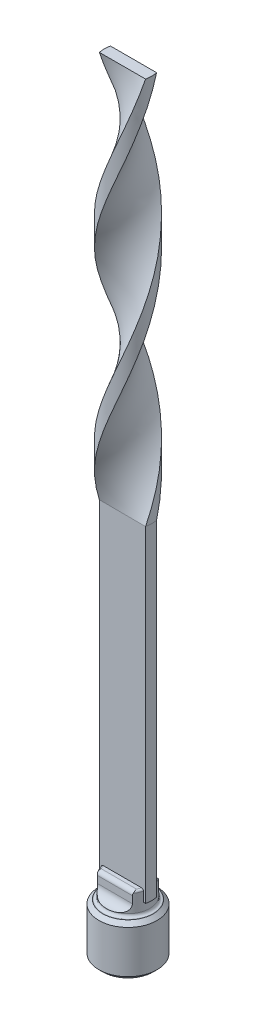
ISO-10303-21;
HEADER;
FILE_DESCRIPTION(('STEP AP214'),'2;1');
FILE_NAME('part.step','',(''),(''),'','','');
FILE_SCHEMA(('AUTOMOTIVE_DESIGN { 1 0 10303 214 1 1 1 1 }'));
ENDSEC;
DATA;
#1=APPLICATION_CONTEXT('core data for automotive mechanical design processes');
#2=APPLICATION_PROTOCOL_DEFINITION('international standard','automotive_design',2000,#1);
#3=PRODUCT_CONTEXT('',#1,'mechanical');
#4=PRODUCT('Part','Part','',(#3));
#5=PRODUCT_RELATED_PRODUCT_CATEGORY('part','',(#4));
#6=PRODUCT_DEFINITION_FORMATION('','',#4);
#7=PRODUCT_DEFINITION_CONTEXT('part definition',#1,'design');
#8=PRODUCT_DEFINITION('design','',#6,#7);
#9=PRODUCT_DEFINITION_SHAPE('','',#8);
#10=(LENGTH_UNIT() NAMED_UNIT(*) SI_UNIT(.MILLI.,.METRE.));
#11=(NAMED_UNIT(*) PLANE_ANGLE_UNIT() SI_UNIT($,.RADIAN.));
#12=(NAMED_UNIT(*) SI_UNIT($,.STERADIAN.) SOLID_ANGLE_UNIT());
#13=UNCERTAINTY_MEASURE_WITH_UNIT(LENGTH_MEASURE(1.E-05),#10,'distance_accuracy_value','');
#14=(GEOMETRIC_REPRESENTATION_CONTEXT(3) GLOBAL_UNCERTAINTY_ASSIGNED_CONTEXT((#13)) GLOBAL_UNIT_ASSIGNED_CONTEXT((#10,
#11,#12)) REPRESENTATION_CONTEXT('',''));
#15=CARTESIAN_POINT('',(0.,0.,0.));
#16=DIRECTION('',(0.,0.,1.));
#17=DIRECTION('',(1.,0.,0.));
#18=AXIS2_PLACEMENT_3D('',#15,#16,#17);
#19=CARTESIAN_POINT('',(0.,5.4102,0.));
#20=DIRECTION('',(0.,-1.,0.));
#21=DIRECTION('',(0.,0.,-1.));
#22=AXIS2_PLACEMENT_3D('',#19,#20,#21);
#23=PLANE('',#22);
#24=DIRECTION('',(-0.866025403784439,0.,0.5));
#25=VECTOR('',#24,1.);
#26=CARTESIAN_POINT('',(0.,5.4102,-2.28769270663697));
#27=LINE('',#26,#25);
#28=CARTESIAN_POINT('',(-1.9812,5.4102,-1.14384635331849));
#29=VERTEX_POINT('',#28);
#30=CARTESIAN_POINT('',(0.,5.4102,-2.28769270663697));
#31=VERTEX_POINT('',#30);
#32=EDGE_CURVE('E978',#29,#31,#27,.F.);
#33=ORIENTED_EDGE('',*,*,#32,.T.);
#34=DIRECTION('',(-0.866025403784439,0.,-0.5));
#35=VECTOR('',#34,1.);
#36=CARTESIAN_POINT('',(1.9812,5.4102,-1.14384635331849));
#37=LINE('',#36,#35);
#38=CARTESIAN_POINT('',(1.9812,5.4102,-1.14384635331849));
#39=VERTEX_POINT('',#38);
#40=EDGE_CURVE('E995',#31,#39,#37,.F.);
#41=ORIENTED_EDGE('',*,*,#40,.T.);
#42=DIRECTION('',(0.,0.,-1.));
#43=VECTOR('',#42,1.);
#44=CARTESIAN_POINT('',(1.9812,5.4102,1.14384635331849));
#45=LINE('',#44,#43);
#46=CARTESIAN_POINT('',(1.9812,5.4102,1.14384635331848));
#47=VERTEX_POINT('',#46);
#48=EDGE_CURVE('E1005',#39,#47,#45,.F.);
#49=ORIENTED_EDGE('',*,*,#48,.T.);
#50=DIRECTION('',(0.866025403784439,0.,-0.5));
#51=VECTOR('',#50,1.);
#52=CARTESIAN_POINT('',(0.,5.4102,2.28769270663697));
#53=LINE('',#52,#51);
#54=CARTESIAN_POINT('',(0.,5.4102,2.28769270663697));
#55=VERTEX_POINT('',#54);
#56=EDGE_CURVE('E1015',#47,#55,#53,.F.);
#57=ORIENTED_EDGE('',*,*,#56,.T.);
#58=DIRECTION('',(0.866025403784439,0.,0.5));
#59=VECTOR('',#58,1.);
#60=CARTESIAN_POINT('',(-1.9812,5.4102,1.14384635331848));
#61=LINE('',#60,#59);
#62=CARTESIAN_POINT('',(-1.9812,5.4102,1.14384635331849));
#63=VERTEX_POINT('',#62);
#64=EDGE_CURVE('E1025',#55,#63,#61,.F.);
#65=ORIENTED_EDGE('',*,*,#64,.T.);
#66=DIRECTION('',(0.,0.,1.));
#67=VECTOR('',#66,1.);
#68=CARTESIAN_POINT('',(-1.9812,5.4102,-1.14384635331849));
#69=LINE('',#68,#67);
#70=EDGE_CURVE('E1029',#63,#29,#69,.F.);
#71=ORIENTED_EDGE('',*,*,#70,.T.);
#72=EDGE_LOOP('',(#33,#41,#49,#57,#65,#71));
#73=FACE_BOUND('',#72,.T.);
#74=ADVANCED_FACE('F14',(#73),#23,.T.);
#75=CARTESIAN_POINT('',(-1.9812,0.,-1.14384635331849));
#76=DIRECTION('',(-1.,0.,0.));
#77=DIRECTION('',(0.,0.,1.));
#78=AXIS2_PLACEMENT_3D('',#75,#76,#77);
#79=PLANE('',#78);
#80=DIRECTION('',(0.,0.,1.));
#81=VECTOR('',#80,1.);
#82=CARTESIAN_POINT('',(-1.9812,0.,-1.14384635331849));
#83=LINE('',#82,#81);
#84=CARTESIAN_POINT('',(-1.9812,0.,-1.14384635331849));
#85=VERTEX_POINT('',#84);
#86=CARTESIAN_POINT('',(-1.9812,-2.84218307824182E-11,-1.14045717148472));
#87=VERTEX_POINT('',#86);
#88=EDGE_CURVE('E153',#85,#87,#83,.T.);
#89=ORIENTED_EDGE('',*,*,#88,.F.);
#90=DIRECTION('',(0.,1.,0.));
#91=VECTOR('',#90,1.);
#92=CARTESIAN_POINT('',(-1.9812,0.,-1.14384635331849));
#93=LINE('',#92,#91);
#94=EDGE_CURVE('E986',#85,#29,#93,.T.);
#95=ORIENTED_EDGE('',*,*,#94,.T.);
#96=ORIENTED_EDGE('',*,*,#70,.F.);
#97=DIRECTION('',(0.,1.,0.));
#98=VECTOR('',#97,1.);
#99=CARTESIAN_POINT('',(-1.9812,0.,1.14384635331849));
#100=LINE('',#99,#98);
#101=CARTESIAN_POINT('',(-1.9812,0.,1.14384635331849));
#102=VERTEX_POINT('',#101);
#103=EDGE_CURVE('E1020',#63,#102,#100,.F.);
#104=ORIENTED_EDGE('',*,*,#103,.T.);
#105=DIRECTION('',(0.,0.,1.));
#106=VECTOR('',#105,1.);
#107=CARTESIAN_POINT('',(-1.9812,0.,-1.14384635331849));
#108=LINE('',#107,#106);
#109=CARTESIAN_POINT('',(-1.9812,-2.84215879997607E-11,1.14045717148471));
#110=VERTEX_POINT('',#109);
#111=EDGE_CURVE('E145',#110,#102,#108,.T.);
#112=ORIENTED_EDGE('',*,*,#111,.F.);
#113=CARTESIAN_POINT('',(-1.9812,-3.09855422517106E-11,1.14045717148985));
#114=CARTESIAN_POINT('',(-1.9812,0.039088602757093,1.0620317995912));
#115=CARTESIAN_POINT('',(-1.9812,0.0758731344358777,0.982297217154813));
#116=CARTESIAN_POINT('',(-1.9812,0.143209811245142,0.81972214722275));
#117=CARTESIAN_POINT('',(-1.9812,0.173724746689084,0.736866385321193));
#118=CARTESIAN_POINT('',(-1.9812,0.2259889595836,0.569794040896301));
#119=CARTESIAN_POINT('',(-1.9812,0.247868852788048,0.485619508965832));
#120=CARTESIAN_POINT('',(-1.9812,0.28157126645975,0.31542781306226));
#121=CARTESIAN_POINT('',(-1.9812,0.293418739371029,0.229415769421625));
#122=CARTESIAN_POINT('',(-1.9812,0.304113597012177,0.081001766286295));
#123=CARTESIAN_POINT('',(-1.9812,0.305686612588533,0.0187887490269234));
#124=CARTESIAN_POINT('',(-1.9812,0.302963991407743,-0.105533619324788));
#125=CARTESIAN_POINT('',(-1.9812,0.298666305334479,-0.167642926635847));
#126=CARTESIAN_POINT('',(-1.9812,0.284446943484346,-0.291272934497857));
#127=CARTESIAN_POINT('',(-1.9812,0.274519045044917,-0.352792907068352));
#128=CARTESIAN_POINT('',(-1.9812,0.249583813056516,-0.474768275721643));
#129=CARTESIAN_POINT('',(-1.9812,0.234576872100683,-0.535223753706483));
#130=CARTESIAN_POINT('',(-1.9812,0.190237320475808,-0.689370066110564));
#131=CARTESIAN_POINT('',(-1.9812,0.157633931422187,-0.782123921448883));
#132=CARTESIAN_POINT('',(-1.9812,0.102626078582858,-0.918529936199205));
#133=CARTESIAN_POINT('',(-1.9812,0.0833037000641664,-0.963484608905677));
#134=CARTESIAN_POINT('',(-1.9812,0.0429026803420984,-1.05256776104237));
#135=CARTESIAN_POINT('',(-1.9812,0.0218250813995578,-1.09669671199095));
#136=CARTESIAN_POINT('',(-1.9812,-3.09860075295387E-11,-1.14045717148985));
#137=B_SPLINE_CURVE_WITH_KNOTS('',3,(#113,#114,#115,#116,#117,#118,#119,#120,#121,#122,#123,
#124,#125,#126,#127,#128,#129,#130,#131,#132,#133,#134,#135,#136),.UNSPECIFIED.,.F.,.F.,(4,2,2,
2,2,2,2,2,2,2,2,4),(0.,0.263061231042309,0.527641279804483,0.788049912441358,1.04780894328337,
1.23424334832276,1.42074284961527,1.6074488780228,1.79414047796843,2.08848357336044,
2.23525258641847,2.38193506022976),.UNSPECIFIED.);
#138=EDGE_CURVE('E390',#110,#87,#137,.T.);
#139=ORIENTED_EDGE('',*,*,#138,.T.);
#140=EDGE_LOOP('',(#89,#95,#96,#104,#112,#139));
#141=FACE_BOUND('',#140,.T.);
#142=ADVANCED_FACE('F399',(#141),#79,.F.);
#143=CARTESIAN_POINT('',(-1.9812,0.,1.14384635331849));
#144=DIRECTION('',(-0.5,0.,0.866025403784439));
#145=DIRECTION('',(0.866025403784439,0.,0.5));
#146=AXIS2_PLACEMENT_3D('',#143,#144,#145);
#147=PLANE('',#146);
#148=DIRECTION('',(0.866025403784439,0.,0.5));
#149=VECTOR('',#148,1.);
#150=CARTESIAN_POINT('',(-1.9812,0.,1.14384635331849));
#151=LINE('',#150,#149);
#152=CARTESIAN_POINT('',(-1.97826488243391,-2.84215880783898E-11,1.14554094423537));
#153=VERTEX_POINT('',#152);
#154=EDGE_CURVE('E1016',#102,#153,#151,.T.);
#155=ORIENTED_EDGE('',*,*,#154,.F.);
#156=ORIENTED_EDGE('',*,*,#103,.F.);
#157=ORIENTED_EDGE('',*,*,#64,.F.);
#158=DIRECTION('',(0.,1.,0.));
#159=VECTOR('',#158,1.);
#160=CARTESIAN_POINT('',(0.,0.,2.28769270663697));
#161=LINE('',#160,#159);
#162=CARTESIAN_POINT('',(0.,0.,2.28769270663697));
#163=VERTEX_POINT('',#162);
#164=EDGE_CURVE('E1010',#55,#163,#161,.F.);
#165=ORIENTED_EDGE('',*,*,#164,.T.);
#166=DIRECTION('',(0.866025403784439,0.,0.5));
#167=VECTOR('',#166,1.);
#168=CARTESIAN_POINT('',(-1.9812,0.,1.14384635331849));
#169=LINE('',#168,#167);
#170=CARTESIAN_POINT('',(-0.00293511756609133,-2.84214839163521E-11,2.28599811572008));
#171=VERTEX_POINT('',#170);
#172=EDGE_CURVE('E1023',#171,#163,#169,.T.);
#173=ORIENTED_EDGE('',*,*,#172,.F.);
#174=CARTESIAN_POINT('',(-0.00293511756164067,-3.0985308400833E-11,2.28599811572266));
#175=CARTESIAN_POINT('',(-0.0708534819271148,0.0390886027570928,2.24678542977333));
#176=CARTESIAN_POINT('',(-0.139905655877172,0.0758731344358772,2.20691813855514));
#177=CARTESIAN_POINT('',(-0.280699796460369,0.143209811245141,2.1256306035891));
#178=CARTESIAN_POINT('',(-0.352454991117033,0.173724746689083,2.08420272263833));
#179=CARTESIAN_POINT('',(-0.497143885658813,0.225988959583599,2.00066655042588));
#180=CARTESIAN_POINT('',(-0.570041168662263,0.247868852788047,1.95857928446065));
#181=CARTESIAN_POINT('',(-0.717431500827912,0.281571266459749,1.87348343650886));
#182=CARTESIAN_POINT('',(-0.791920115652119,0.293418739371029,1.83047741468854));
#183=CARTESIAN_POINT('',(-0.920450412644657,0.304113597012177,1.75627041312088));
#184=CARTESIAN_POINT('',(-0.974328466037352,0.305686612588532,1.72516390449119));
#185=CARTESIAN_POINT('',(-1.08199479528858,0.302963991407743,1.66300272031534));
#186=CARTESIAN_POINT('',(-1.13578303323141,0.298666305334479,1.63194806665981));
#187=CARTESIAN_POINT('',(-1.24284976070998,0.284446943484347,1.5701330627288));
#188=CARTESIAN_POINT('',(-1.29612761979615,0.274519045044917,1.53937307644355));
#189=CARTESIAN_POINT('',(-1.40176138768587,0.249583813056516,1.47838539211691));
#190=CARTESIAN_POINT('',(-1.45411736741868,0.234576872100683,1.44815765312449));
#191=CARTESIAN_POINT('',(-1.5876119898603,0.190237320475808,1.37108449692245));
#192=CARTESIAN_POINT('',(-1.66793918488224,0.157633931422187,1.32470756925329));
#193=CARTESIAN_POINT('',(-1.78607025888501,0.102626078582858,1.25650456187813));
#194=CARTESIAN_POINT('',(-1.82500214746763,0.0833037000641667,1.23402722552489));
#195=CARTESIAN_POINT('',(-1.9021504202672,0.0429026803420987,1.18948564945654));
#196=CARTESIAN_POINT('',(-1.94036721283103,0.0218250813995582,1.16742117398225));
#197=CARTESIAN_POINT('',(-1.97826488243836,-3.09851255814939E-11,1.1455409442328));
#198=B_SPLINE_CURVE_WITH_KNOTS('',3,(#174,#175,#176,#177,#178,#179,#180,#181,#182,#183,#184,
#185,#186,#187,#188,#189,#190,#191,#192,#193,#194,#195,#196,#197),.UNSPECIFIED.,.F.,.F.,(4,2,2,
2,2,2,2,2,2,2,2,4),(0.,0.263061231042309,0.527641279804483,0.788049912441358,1.04780894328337,
1.23424334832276,1.42074284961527,1.6074488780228,1.79414047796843,2.08848357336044,
2.23525258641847,2.38193506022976),.UNSPECIFIED.);
#199=EDGE_CURVE('E383',#171,#153,#198,.T.);
#200=ORIENTED_EDGE('',*,*,#199,.T.);
#201=EDGE_LOOP('',(#155,#156,#157,#165,#173,#200));
#202=FACE_BOUND('',#201,.T.);
#203=ADVANCED_FACE('F396',(#202),#147,.F.);
#204=CARTESIAN_POINT('',(0.,0.,2.28769270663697));
#205=DIRECTION('',(0.5,0.,0.866025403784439));
#206=DIRECTION('',(0.866025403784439,0.,-0.5));
#207=AXIS2_PLACEMENT_3D('',#204,#205,#206);
#208=PLANE('',#207);
#209=DIRECTION('',(0.866025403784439,0.,-0.5));
#210=VECTOR('',#209,1.);
#211=CARTESIAN_POINT('',(0.,0.,2.28769270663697));
#212=LINE('',#211,#210);
#213=CARTESIAN_POINT('',(0.00293511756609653,-2.84214667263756E-11,2.28599811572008));
#214=VERTEX_POINT('',#213);
#215=EDGE_CURVE('E1006',#163,#214,#212,.T.);
#216=ORIENTED_EDGE('',*,*,#215,.F.);
#217=ORIENTED_EDGE('',*,*,#164,.F.);
#218=ORIENTED_EDGE('',*,*,#56,.F.);
#219=DIRECTION('',(0.,1.,0.));
#220=VECTOR('',#219,1.);
#221=CARTESIAN_POINT('',(1.9812,0.,1.14384635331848));
#222=LINE('',#221,#220);
#223=CARTESIAN_POINT('',(1.9812,0.,1.14384635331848));
#224=VERTEX_POINT('',#223);
#225=EDGE_CURVE('E1000',#47,#224,#222,.F.);
#226=ORIENTED_EDGE('',*,*,#225,.T.);
#227=DIRECTION('',(0.866025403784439,0.,-0.5));
#228=VECTOR('',#227,1.);
#229=CARTESIAN_POINT('',(0.,0.,2.28769270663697));
#230=LINE('',#229,#228);
#231=CARTESIAN_POINT('',(1.97826488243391,-2.84215186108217E-11,1.14554094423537));
#232=VERTEX_POINT('',#231);
#233=EDGE_CURVE('E1013',#232,#224,#230,.T.);
#234=ORIENTED_EDGE('',*,*,#233,.F.);
#235=CARTESIAN_POINT('',(1.97826488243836,-3.09878604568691E-11,1.1455409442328));
#236=CARTESIAN_POINT('',(1.91034651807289,0.0390886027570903,1.18475363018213));
#237=CARTESIAN_POINT('',(1.84129434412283,0.0758731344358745,1.22462092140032));
#238=CARTESIAN_POINT('',(1.70050020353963,0.143209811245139,1.30590845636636));
#239=CARTESIAN_POINT('',(1.62874500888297,0.17372474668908,1.34733633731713));
#240=CARTESIAN_POINT('',(1.48405611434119,0.225988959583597,1.43087250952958));
#241=CARTESIAN_POINT('',(1.41115883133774,0.247868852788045,1.47295977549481));
#242=CARTESIAN_POINT('',(1.26376849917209,0.281571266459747,1.5580556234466));
#243=CARTESIAN_POINT('',(1.18927988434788,0.293418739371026,1.60106164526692));
#244=CARTESIAN_POINT('',(1.06074958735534,0.304113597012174,1.67526864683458));
#245=CARTESIAN_POINT('',(1.00687153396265,0.30568661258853,1.70637515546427));
#246=CARTESIAN_POINT('',(0.89920520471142,0.30296399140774,1.76853633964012));
#247=CARTESIAN_POINT('',(0.845416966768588,0.298666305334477,1.79959099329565));
#248=CARTESIAN_POINT('',(0.738350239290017,0.284446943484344,1.86140599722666));
#249=CARTESIAN_POINT('',(0.685072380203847,0.274519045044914,1.89216598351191));
#250=CARTESIAN_POINT('',(0.579438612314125,0.249583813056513,1.95315366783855));
#251=CARTESIAN_POINT('',(0.527082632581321,0.234576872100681,1.98338140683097));
#252=CARTESIAN_POINT('',(0.393588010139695,0.190237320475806,2.06045456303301));
#253=CARTESIAN_POINT('',(0.313260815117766,0.157633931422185,2.10683149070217));
#254=CARTESIAN_POINT('',(0.195129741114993,0.102626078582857,2.17503449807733));
#255=CARTESIAN_POINT('',(0.156197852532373,0.0833037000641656,2.19751183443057));
#256=CARTESIAN_POINT('',(0.0790495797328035,0.0429026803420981,2.24205341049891));
#257=CARTESIAN_POINT('',(0.040832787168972,0.0218250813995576,2.26411788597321));
#258=CARTESIAN_POINT('',(0.00293511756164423,-3.09864500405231E-11,2.28599811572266));
#259=B_SPLINE_CURVE_WITH_KNOTS('',3,(#235,#236,#237,#238,#239,#240,#241,#242,#243,#244,#245,
#246,#247,#248,#249,#250,#251,#252,#253,#254,#255,#256,#257,#258),.UNSPECIFIED.,.F.,.F.,(4,2,2,
2,2,2,2,2,2,2,2,4),(0.,0.263061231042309,0.527641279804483,0.788049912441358,1.04780894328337,
1.23424334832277,1.42074284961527,1.6074488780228,1.79414047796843,2.08848357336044,
2.23525258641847,2.38193506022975),.UNSPECIFIED.);
#260=EDGE_CURVE('E364',#232,#214,#259,.T.);
#261=ORIENTED_EDGE('',*,*,#260,.T.);
#262=EDGE_LOOP('',(#216,#217,#218,#226,#234,#261));
#263=FACE_BOUND('',#262,.T.);
#264=ADVANCED_FACE('F353',(#263),#208,.F.);
#265=CARTESIAN_POINT('',(1.9812,0.,1.14384635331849));
#266=DIRECTION('',(1.,0.,0.));
#267=DIRECTION('',(0.,0.,-1.));
#268=AXIS2_PLACEMENT_3D('',#265,#266,#267);
#269=PLANE('',#268);
#270=DIRECTION('',(0.,0.,-1.));
#271=VECTOR('',#270,1.);
#272=CARTESIAN_POINT('',(1.9812,0.,1.14384635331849));
#273=LINE('',#272,#271);
#274=CARTESIAN_POINT('',(1.9812,-2.84215880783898E-11,1.14045717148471));
#275=VERTEX_POINT('',#274);
#276=EDGE_CURVE('E996',#224,#275,#273,.T.);
#277=ORIENTED_EDGE('',*,*,#276,.F.);
#278=ORIENTED_EDGE('',*,*,#225,.F.);
#279=ORIENTED_EDGE('',*,*,#48,.F.);
#280=DIRECTION('',(0.,1.,0.));
#281=VECTOR('',#280,1.);
#282=CARTESIAN_POINT('',(1.9812,0.,-1.14384635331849));
#283=LINE('',#282,#281);
#284=CARTESIAN_POINT('',(1.9812,0.,-1.14384635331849));
#285=VERTEX_POINT('',#284);
#286=EDGE_CURVE('E991',#39,#285,#283,.F.);
#287=ORIENTED_EDGE('',*,*,#286,.T.);
#288=DIRECTION('',(0.,0.,-1.));
#289=VECTOR('',#288,1.);
#290=CARTESIAN_POINT('',(1.9812,0.,1.14384635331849));
#291=LINE('',#290,#289);
#292=CARTESIAN_POINT('',(1.9812,-2.84217788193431E-11,-1.14045717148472));
#293=VERTEX_POINT('',#292);
#294=EDGE_CURVE('E1003',#293,#285,#291,.T.);
#295=ORIENTED_EDGE('',*,*,#294,.F.);
#296=CARTESIAN_POINT('',(1.9812,-3.0986044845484E-11,-1.14045717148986));
#297=CARTESIAN_POINT('',(1.9812,0.0390886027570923,-1.06203179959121));
#298=CARTESIAN_POINT('',(1.9812,0.0758731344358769,-0.982297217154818));
#299=CARTESIAN_POINT('',(1.9812,0.143209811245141,-0.819722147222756));
#300=CARTESIAN_POINT('',(1.9812,0.173724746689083,-0.736866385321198));
#301=CARTESIAN_POINT('',(1.9812,0.2259889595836,-0.569794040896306));
#302=CARTESIAN_POINT('',(1.9812,0.247868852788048,-0.485619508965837));
#303=CARTESIAN_POINT('',(1.9812,0.28157126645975,-0.315427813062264));
#304=CARTESIAN_POINT('',(1.9812,0.293418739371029,-0.229415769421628));
#305=CARTESIAN_POINT('',(1.9812,0.304113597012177,-0.0810017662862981));
#306=CARTESIAN_POINT('',(1.9812,0.305686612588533,-0.0187887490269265));
#307=CARTESIAN_POINT('',(1.9812,0.302963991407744,0.105533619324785));
#308=CARTESIAN_POINT('',(1.9812,0.29866630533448,0.167642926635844));
#309=CARTESIAN_POINT('',(1.9812,0.284446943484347,0.291272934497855));
#310=CARTESIAN_POINT('',(1.9812,0.274519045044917,0.352792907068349));
#311=CARTESIAN_POINT('',(1.9812,0.249583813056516,0.47476827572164));
#312=CARTESIAN_POINT('',(1.9812,0.234576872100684,0.53522375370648));
#313=CARTESIAN_POINT('',(1.9812,0.190237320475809,0.689370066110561));
#314=CARTESIAN_POINT('',(1.9812,0.157633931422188,0.78212392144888));
#315=CARTESIAN_POINT('',(1.9812,0.102626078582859,0.918529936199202));
#316=CARTESIAN_POINT('',(1.9812,0.0833037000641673,0.963484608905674));
#317=CARTESIAN_POINT('',(1.9812,0.0429026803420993,1.05256776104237));
#318=CARTESIAN_POINT('',(1.9812,0.0218250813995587,1.09669671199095));
#319=CARTESIAN_POINT('',(1.9812,-3.09851446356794E-11,1.14045717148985));
#320=B_SPLINE_CURVE_WITH_KNOTS('',3,(#296,#297,#298,#299,#300,#301,#302,#303,#304,#305,#306,
#307,#308,#309,#310,#311,#312,#313,#314,#315,#316,#317,#318,#319),.UNSPECIFIED.,.F.,.F.,(4,2,2,
2,2,2,2,2,2,2,2,4),(0.,0.26306123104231,0.527641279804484,0.78804991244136,1.04780894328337,
1.23424334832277,1.42074284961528,1.6074488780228,1.79414047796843,2.08848357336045,
2.23525258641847,2.38193506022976),.UNSPECIFIED.);
#321=EDGE_CURVE('E357',#293,#275,#320,.T.);
#322=ORIENTED_EDGE('',*,*,#321,.T.);
#323=EDGE_LOOP('',(#277,#278,#279,#287,#295,#322));
#324=FACE_BOUND('',#323,.T.);
#325=ADVANCED_FACE('F348',(#324),#269,.F.);
#326=CARTESIAN_POINT('',(1.9812,0.,-1.14384635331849));
#327=DIRECTION('',(0.5,0.,-0.866025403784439));
#328=DIRECTION('',(-0.866025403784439,0.,-0.5));
#329=AXIS2_PLACEMENT_3D('',#326,#327,#328);
#330=PLANE('',#329);
#331=DIRECTION('',(-0.866025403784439,0.,-0.5));
#332=VECTOR('',#331,1.);
#333=CARTESIAN_POINT('',(1.9812,0.,-1.14384635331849));
#334=LINE('',#333,#332);
#335=CARTESIAN_POINT('',(1.97826488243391,-2.84218307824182E-11,-1.14554094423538));
#336=VERTEX_POINT('',#335);
#337=EDGE_CURVE('E987',#285,#336,#334,.T.);
#338=ORIENTED_EDGE('',*,*,#337,.F.);
#339=ORIENTED_EDGE('',*,*,#286,.F.);
#340=ORIENTED_EDGE('',*,*,#40,.F.);
#341=DIRECTION('',(0.,1.,0.));
#342=VECTOR('',#341,1.);
#343=CARTESIAN_POINT('',(0.,0.,-2.28769270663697));
#344=LINE('',#343,#342);
#345=CARTESIAN_POINT('',(0.,0.,-2.28769270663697));
#346=VERTEX_POINT('',#345);
#347=EDGE_CURVE('E975',#31,#346,#344,.F.);
#348=ORIENTED_EDGE('',*,*,#347,.T.);
#349=DIRECTION('',(-0.866025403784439,0.,-0.5));
#350=VECTOR('',#349,1.);
#351=CARTESIAN_POINT('',(1.9812,0.,-1.14384635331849));
#352=LINE('',#351,#350);
#353=CARTESIAN_POINT('',(0.00293511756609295,-2.84219522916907E-11,-2.28599811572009));
#354=VERTEX_POINT('',#353);
#355=EDGE_CURVE('E158',#354,#346,#352,.T.);
#356=ORIENTED_EDGE('',*,*,#355,.F.);
#357=CARTESIAN_POINT('',(0.00293511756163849,-3.09882768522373E-11,-2.28599811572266));
#358=CARTESIAN_POINT('',(0.0708534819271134,0.0390886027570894,-2.24678542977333));
#359=CARTESIAN_POINT('',(0.139905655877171,0.075873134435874,-2.20691813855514));
#360=CARTESIAN_POINT('',(0.280699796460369,0.143209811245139,-2.12563060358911));
#361=CARTESIAN_POINT('',(0.352454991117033,0.173724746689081,-2.08420272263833));
#362=CARTESIAN_POINT('',(0.497143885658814,0.225988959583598,-2.00066655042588));
#363=CARTESIAN_POINT('',(0.570041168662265,0.247868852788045,-1.95857928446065));
#364=CARTESIAN_POINT('',(0.717431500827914,0.281571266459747,-1.87348343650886));
#365=CARTESIAN_POINT('',(0.791920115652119,0.293418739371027,-1.83047741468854));
#366=CARTESIAN_POINT('',(0.920450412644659,0.304113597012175,-1.75627041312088));
#367=CARTESIAN_POINT('',(0.974328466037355,0.30568661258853,-1.72516390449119));
#368=CARTESIAN_POINT('',(1.08199479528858,0.30296399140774,-1.66300272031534));
#369=CARTESIAN_POINT('',(1.13578303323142,0.298666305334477,-1.63194806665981));
#370=CARTESIAN_POINT('',(1.24284976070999,0.284446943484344,-1.5701330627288));
#371=CARTESIAN_POINT('',(1.29612761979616,0.274519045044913,-1.53937307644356));
#372=CARTESIAN_POINT('',(1.40176138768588,0.249583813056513,-1.47838539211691));
#373=CARTESIAN_POINT('',(1.45411736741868,0.234576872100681,-1.44815765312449));
#374=CARTESIAN_POINT('',(1.58761198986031,0.190237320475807,-1.37108449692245));
#375=CARTESIAN_POINT('',(1.66793918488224,0.157633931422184,-1.32470756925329));
#376=CARTESIAN_POINT('',(1.78607025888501,0.102626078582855,-1.25650456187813));
#377=CARTESIAN_POINT('',(1.82500214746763,0.083303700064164,-1.23402722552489));
#378=CARTESIAN_POINT('',(1.9021504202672,0.0429026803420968,-1.18948564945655));
#379=CARTESIAN_POINT('',(1.94036721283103,0.0218250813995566,-1.16742117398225));
#380=CARTESIAN_POINT('',(1.97826488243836,-3.09871694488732E-11,-1.1455409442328));
#381=B_SPLINE_CURVE_WITH_KNOTS('',3,(#357,#358,#359,#360,#361,#362,#363,#364,#365,#366,#367,
#368,#369,#370,#371,#372,#373,#374,#375,#376,#377,#378,#379,#380),.UNSPECIFIED.,.F.,.F.,(4,2,2,
2,2,2,2,2,2,2,2,4),(0.,0.26306123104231,0.527641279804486,0.788049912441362,1.04780894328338,
1.23424334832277,1.42074284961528,1.60744887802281,1.79414047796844,2.08848357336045,
2.23525258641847,2.38193506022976),.UNSPECIFIED.);
#382=EDGE_CURVE('E328',#354,#336,#381,.T.);
#383=ORIENTED_EDGE('',*,*,#382,.T.);
#384=EDGE_LOOP('',(#338,#339,#340,#348,#356,#383));
#385=FACE_BOUND('',#384,.T.);
#386=ADVANCED_FACE('F341',(#385),#330,.F.);
#387=CARTESIAN_POINT('',(0.,0.,-2.28769270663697));
#388=DIRECTION('',(-0.5,0.,-0.866025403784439));
#389=DIRECTION('',(-0.866025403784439,0.,0.5));
#390=AXIS2_PLACEMENT_3D('',#387,#388,#389);
#391=PLANE('',#390);
#392=DIRECTION('',(-0.866025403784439,0.,0.5));
#393=VECTOR('',#392,1.);
#394=CARTESIAN_POINT('',(0.,0.,-2.28769270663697));
#395=LINE('',#394,#393);
#396=CARTESIAN_POINT('',(-0.00293511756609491,-2.84219521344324E-11,-2.28599811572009));
#397=VERTEX_POINT('',#396);
#398=EDGE_CURVE('E974',#346,#397,#395,.T.);
#399=ORIENTED_EDGE('',*,*,#398,.F.);
#400=ORIENTED_EDGE('',*,*,#347,.F.);
#401=ORIENTED_EDGE('',*,*,#32,.F.);
#402=ORIENTED_EDGE('',*,*,#94,.F.);
#403=DIRECTION('',(-0.866025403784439,0.,0.5));
#404=VECTOR('',#403,1.);
#405=CARTESIAN_POINT('',(0.,0.,-2.28769270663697));
#406=LINE('',#405,#404);
#407=CARTESIAN_POINT('',(-1.97826488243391,-2.84218829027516E-11,-1.14554094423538));
#408=VERTEX_POINT('',#407);
#409=EDGE_CURVE('E984',#408,#85,#406,.T.);
#410=ORIENTED_EDGE('',*,*,#409,.F.);
#411=CARTESIAN_POINT('',(-1.97826488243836,-3.09882194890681E-11,-1.1455409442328));
#412=CARTESIAN_POINT('',(-1.91034651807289,0.0390886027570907,-1.18475363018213));
#413=CARTESIAN_POINT('',(-1.84129434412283,0.0758731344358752,-1.22462092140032));
#414=CARTESIAN_POINT('',(-1.70050020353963,0.143209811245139,-1.30590845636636));
#415=CARTESIAN_POINT('',(-1.62874500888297,0.173724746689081,-1.34733633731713));
#416=CARTESIAN_POINT('',(-1.48405611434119,0.225988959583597,-1.43087250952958));
#417=CARTESIAN_POINT('',(-1.41115883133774,0.247868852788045,-1.47295977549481));
#418=CARTESIAN_POINT('',(-1.26376849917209,0.281571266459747,-1.5580556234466));
#419=CARTESIAN_POINT('',(-1.18927988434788,0.293418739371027,-1.60106164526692));
#420=CARTESIAN_POINT('',(-1.06074958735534,0.304113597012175,-1.67526864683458));
#421=CARTESIAN_POINT('',(-1.00687153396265,0.305686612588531,-1.70637515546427));
#422=CARTESIAN_POINT('',(-0.899205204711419,0.302963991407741,-1.76853633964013));
#423=CARTESIAN_POINT('',(-0.845416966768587,0.298666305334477,-1.79959099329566));
#424=CARTESIAN_POINT('',(-0.738350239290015,0.284446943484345,-1.86140599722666));
#425=CARTESIAN_POINT('',(-0.685072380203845,0.274519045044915,-1.89216598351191));
#426=CARTESIAN_POINT('',(-0.579438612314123,0.249583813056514,-1.95315366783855));
#427=CARTESIAN_POINT('',(-0.52708263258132,0.234576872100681,-1.98338140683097));
#428=CARTESIAN_POINT('',(-0.393588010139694,0.190237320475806,-2.06045456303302));
#429=CARTESIAN_POINT('',(-0.313260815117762,0.157633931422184,-2.10683149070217));
#430=CARTESIAN_POINT('',(-0.195129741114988,0.102626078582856,-2.17503449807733));
#431=CARTESIAN_POINT('',(-0.156197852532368,0.0833037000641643,-2.19751183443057));
#432=CARTESIAN_POINT('',(-0.0790495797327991,0.0429026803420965,-2.24205341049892));
#433=CARTESIAN_POINT('',(-0.040832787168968,0.0218250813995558,-2.26411788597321));
#434=CARTESIAN_POINT('',(-0.00293511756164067,-3.0988123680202E-11,-2.28599811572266));
#435=B_SPLINE_CURVE_WITH_KNOTS('',3,(#411,#412,#413,#414,#415,#416,#417,#418,#419,#420,#421,
#422,#423,#424,#425,#426,#427,#428,#429,#430,#431,#432,#433,#434),.UNSPECIFIED.,.F.,.F.,(4,2,2,
2,2,2,2,2,2,2,2,4),(0.,0.263061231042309,0.527641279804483,0.788049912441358,1.04780894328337,
1.23424334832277,1.42074284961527,1.6074488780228,1.79414047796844,2.08848357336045,
2.23525258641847,2.38193506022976),.UNSPECIFIED.);
#436=EDGE_CURVE('E318',#408,#397,#435,.T.);
#437=ORIENTED_EDGE('',*,*,#436,.T.);
#438=EDGE_LOOP('',(#399,#400,#401,#402,#410,#437));
#439=FACE_BOUND('',#438,.T.);
#440=ADVANCED_FACE('F336',(#439),#391,.F.);
#441=CARTESIAN_POINT('',(0.,-5.6843418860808E-11,0.));
#442=DIRECTION('',(0.,-1.,0.));
#443=DIRECTION('',(0.,0.,-1.));
#444=AXIS2_PLACEMENT_3D('',#441,#442,#443);
#445=CONICAL_SURFACE('',#444,2.28600000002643,0.785398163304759);
#446=CARTESIAN_POINT('',(0.,-5.6843418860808E-11,0.));
#447=DIRECTION('',(0.,-1.,0.));
#448=DIRECTION('',(0.,0.,-1.));
#449=AXIS2_PLACEMENT_3D('',#446,#447,#448);
#450=CIRCLE('',#449,2.28600000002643);
#451=EDGE_CURVE('E327',#87,#110,#450,.F.);
#452=ORIENTED_EDGE('',*,*,#451,.F.);
#453=ORIENTED_EDGE('',*,*,#138,.F.);
#454=EDGE_LOOP('',(#452,#453));
#455=FACE_BOUND('',#454,.T.);
#456=ADVANCED_FACE('F340',(#455),#445,.F.);
#457=CARTESIAN_POINT('',(0.,-5.6843418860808E-11,0.));
#458=DIRECTION('',(0.,-1.,0.));
#459=DIRECTION('',(0.,0.,-1.));
#460=AXIS2_PLACEMENT_3D('',#457,#458,#459);
#461=CONICAL_SURFACE('',#460,2.28600000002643,0.785398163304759);
#462=CARTESIAN_POINT('',(0.,-5.6843418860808E-11,0.));
#463=DIRECTION('',(0.,-1.,0.));
#464=DIRECTION('',(0.,0.,-1.));
#465=AXIS2_PLACEMENT_3D('',#462,#463,#464);
#466=CIRCLE('',#465,2.28600000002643);
#467=EDGE_CURVE('E968',#153,#171,#466,.F.);
#468=ORIENTED_EDGE('',*,*,#467,.F.);
#469=ORIENTED_EDGE('',*,*,#199,.F.);
#470=EDGE_LOOP('',(#468,#469));
#471=FACE_BOUND('',#470,.T.);
#472=ADVANCED_FACE('F378',(#471),#461,.F.);
#473=CARTESIAN_POINT('',(0.,-5.6843418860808E-11,0.));
#474=DIRECTION('',(0.,-1.,0.));
#475=DIRECTION('',(0.,0.,-1.));
#476=AXIS2_PLACEMENT_3D('',#473,#474,#475);
#477=CONICAL_SURFACE('',#476,2.28600000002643,0.785398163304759);
#478=CARTESIAN_POINT('',(0.,-5.6843418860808E-11,0.));
#479=DIRECTION('',(0.,-1.,0.));
#480=DIRECTION('',(0.,0.,-1.));
#481=AXIS2_PLACEMENT_3D('',#478,#479,#480);
#482=CIRCLE('',#481,2.28600000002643);
#483=EDGE_CURVE('E966',#214,#232,#482,.F.);
#484=ORIENTED_EDGE('',*,*,#483,.F.);
#485=ORIENTED_EDGE('',*,*,#260,.F.);
#486=EDGE_LOOP('',(#484,#485));
#487=FACE_BOUND('',#486,.T.);
#488=ADVANCED_FACE('F374',(#487),#477,.F.);
#489=CARTESIAN_POINT('',(0.,-5.6843418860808E-11,0.));
#490=DIRECTION('',(0.,-1.,0.));
#491=DIRECTION('',(0.,0.,-1.));
#492=AXIS2_PLACEMENT_3D('',#489,#490,#491);
#493=CONICAL_SURFACE('',#492,2.28600000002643,0.785398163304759);
#494=CARTESIAN_POINT('',(0.,-5.6843418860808E-11,0.));
#495=DIRECTION('',(0.,-1.,0.));
#496=DIRECTION('',(0.,0.,-1.));
#497=AXIS2_PLACEMENT_3D('',#494,#495,#496);
#498=CIRCLE('',#497,2.28600000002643);
#499=EDGE_CURVE('E963',#275,#293,#498,.F.);
#500=ORIENTED_EDGE('',*,*,#499,.F.);
#501=ORIENTED_EDGE('',*,*,#321,.F.);
#502=EDGE_LOOP('',(#500,#501));
#503=FACE_BOUND('',#502,.T.);
#504=ADVANCED_FACE('F371',(#503),#493,.F.);
#505=CARTESIAN_POINT('',(0.,-5.6843418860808E-11,0.));
#506=DIRECTION('',(0.,-1.,0.));
#507=DIRECTION('',(0.,0.,-1.));
#508=AXIS2_PLACEMENT_3D('',#505,#506,#507);
#509=CONICAL_SURFACE('',#508,2.28600000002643,0.785398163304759);
#510=CARTESIAN_POINT('',(0.,-5.6843418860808E-11,0.));
#511=DIRECTION('',(0.,-1.,0.));
#512=DIRECTION('',(0.,0.,-1.));
#513=AXIS2_PLACEMENT_3D('',#510,#511,#512);
#514=CIRCLE('',#513,2.28600000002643);
#515=EDGE_CURVE('E961',#336,#354,#514,.F.);
#516=ORIENTED_EDGE('',*,*,#515,.F.);
#517=ORIENTED_EDGE('',*,*,#382,.F.);
#518=EDGE_LOOP('',(#516,#517));
#519=FACE_BOUND('',#518,.T.);
#520=ADVANCED_FACE('F313',(#519),#509,.F.);
#521=CARTESIAN_POINT('',(0.,-5.6843418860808E-11,0.));
#522=DIRECTION('',(0.,-1.,0.));
#523=DIRECTION('',(0.,0.,-1.));
#524=AXIS2_PLACEMENT_3D('',#521,#522,#523);
#525=CONICAL_SURFACE('',#524,2.28600000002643,0.785398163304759);
#526=CARTESIAN_POINT('',(0.,-5.6843418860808E-11,0.));
#527=DIRECTION('',(0.,-1.,0.));
#528=DIRECTION('',(0.,0.,-1.));
#529=AXIS2_PLACEMENT_3D('',#526,#527,#528);
#530=CIRCLE('',#529,2.28600000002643);
#531=EDGE_CURVE('E958',#397,#408,#530,.F.);
#532=ORIENTED_EDGE('',*,*,#531,.F.);
#533=ORIENTED_EDGE('',*,*,#436,.F.);
#534=EDGE_LOOP('',(#532,#533));
#535=FACE_BOUND('',#534,.T.);
#536=ADVANCED_FACE('F309',(#535),#525,.F.);
#537=CARTESIAN_POINT('',(0.,0.,-1.905));
#538=DIRECTION('',(0.,-1.,0.));
#539=DIRECTION('',(0.,0.,-1.));
#540=AXIS2_PLACEMENT_3D('',#537,#538,#539);
#541=PLANE('',#540);
#542=ORIENTED_EDGE('',*,*,#531,.T.);
#543=ORIENTED_EDGE('',*,*,#409,.T.);
#544=ORIENTED_EDGE('',*,*,#88,.T.);
#545=ORIENTED_EDGE('',*,*,#451,.T.);
#546=ORIENTED_EDGE('',*,*,#111,.T.);
#547=ORIENTED_EDGE('',*,*,#154,.T.);
#548=ORIENTED_EDGE('',*,*,#467,.T.);
#549=ORIENTED_EDGE('',*,*,#172,.T.);
#550=ORIENTED_EDGE('',*,*,#215,.T.);
#551=ORIENTED_EDGE('',*,*,#483,.T.);
#552=ORIENTED_EDGE('',*,*,#233,.T.);
#553=ORIENTED_EDGE('',*,*,#276,.T.);
#554=ORIENTED_EDGE('',*,*,#499,.T.);
#555=ORIENTED_EDGE('',*,*,#294,.T.);
#556=ORIENTED_EDGE('',*,*,#337,.T.);
#557=ORIENTED_EDGE('',*,*,#515,.T.);
#558=ORIENTED_EDGE('',*,*,#355,.T.);
#559=ORIENTED_EDGE('',*,*,#398,.T.);
#560=EDGE_LOOP('',(#542,#543,#544,#545,#546,#547,#548,#549,#550,#551,#552,#553,#554,#555,#556,
#557,#558,#559));
#561=FACE_BOUND('',#560,.T.);
#562=CARTESIAN_POINT('',(0.,-1.13687705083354E-10,0.));
#563=DIRECTION('',(0.,1.,0.));
#564=DIRECTION('',(0.,0.,1.));
#565=AXIS2_PLACEMENT_3D('',#562,#563,#564);
#566=CIRCLE('',#565,3.30200000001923);
#567=CARTESIAN_POINT('',(0.,-1.13687705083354E-10,3.30200000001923));
#568=VERTEX_POINT('',#567);
#569=EDGE_CURVE('E955',#568,#568,#566,.T.);
#570=ORIENTED_EDGE('',*,*,#569,.F.);
#571=EDGE_LOOP('',(#570));
#572=FACE_BOUND('',#571,.T.);
#573=ADVANCED_FACE('F305',(#561,#572),#541,.T.);
#574=CARTESIAN_POINT('',(0.,0.505999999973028,0.));
#575=DIRECTION('',(0.,1.,0.));
#576=DIRECTION('',(0.,0.,1.));
#577=AXIS2_PLACEMENT_3D('',#574,#575,#576);
#578=CONICAL_SURFACE('',#577,3.80800000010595,0.785398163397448);
#579=CARTESIAN_POINT('',(0.,0.506,0.));
#580=DIRECTION('',(0.,-1.,0.));
#581=DIRECTION('',(0.,0.,-1.));
#582=AXIS2_PLACEMENT_3D('',#579,#580,#581);
#583=CIRCLE('',#582,3.808);
#584=CARTESIAN_POINT('',(0.,0.506,-3.808));
#585=VERTEX_POINT('',#584);
#586=EDGE_CURVE('E240',#585,#585,#583,.F.);
#587=ORIENTED_EDGE('',*,*,#586,.F.);
#588=EDGE_LOOP('',(#587));
#589=FACE_BOUND('',#588,.T.);
#590=ORIENTED_EDGE('',*,*,#569,.T.);
#591=EDGE_LOOP('',(#590));
#592=FACE_BOUND('',#591,.T.);
#593=ADVANCED_FACE('F301',(#589,#592),#578,.T.);
#594=CARTESIAN_POINT('',(0.,3.302,0.));
#595=DIRECTION('',(0.,-1.,0.));
#596=DIRECTION('',(0.,0.,-1.));
#597=AXIS2_PLACEMENT_3D('',#594,#595,#596);
#598=CYLINDRICAL_SURFACE('',#597,3.808);
#599=CARTESIAN_POINT('',(0.,6.0980000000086,0.));
#600=DIRECTION('',(0.,-1.,0.));
#601=DIRECTION('',(0.,0.,1.));
#602=AXIS2_PLACEMENT_3D('',#599,#600,#601);
#603=CIRCLE('',#602,3.80799999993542);
#604=CARTESIAN_POINT('',(0.,6.0980000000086,3.80799999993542));
#605=VERTEX_POINT('',#604);
#606=EDGE_CURVE('E954',#605,#605,#603,.F.);
#607=ORIENTED_EDGE('',*,*,#606,.F.);
#608=EDGE_LOOP('',(#607));
#609=FACE_BOUND('',#608,.T.);
#610=ORIENTED_EDGE('',*,*,#586,.T.);
#611=EDGE_LOOP('',(#610));
#612=FACE_BOUND('',#611,.T.);
#613=ADVANCED_FACE('F297',(#609,#612),#598,.T.);
#614=CARTESIAN_POINT('',(0.,6.0980000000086,0.));
#615=DIRECTION('',(0.,-1.,0.));
#616=DIRECTION('',(1.,0.,0.));
#617=AXIS2_PLACEMENT_3D('',#614,#615,#616);
#618=CONICAL_SURFACE('',#617,3.80799999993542,0.785398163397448);
#619=CARTESIAN_POINT('',(0.,6.60399999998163,0.));
#620=DIRECTION('',(0.,-1.,0.));
#621=DIRECTION('',(1.,0.,0.));
#622=AXIS2_PLACEMENT_3D('',#619,#620,#621);
#623=CIRCLE('',#622,3.30199999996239);
#624=CARTESIAN_POINT('',(3.30199999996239,6.60399999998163,0.));
#625=VERTEX_POINT('',#624);
#626=EDGE_CURVE('E231',#625,#625,#623,.F.);
#627=ORIENTED_EDGE('',*,*,#626,.F.);
#628=EDGE_LOOP('',(#627));
#629=FACE_BOUND('',#628,.T.);
#630=ORIENTED_EDGE('',*,*,#606,.T.);
#631=EDGE_LOOP('',(#630));
#632=FACE_BOUND('',#631,.T.);
#633=ADVANCED_FACE('F286',(#629,#632),#618,.T.);
#634=CARTESIAN_POINT('',(0.,6.604,-3.81));
#635=DIRECTION('',(0.,1.,0.));
#636=DIRECTION('',(0.,0.,1.));
#637=AXIS2_PLACEMENT_3D('',#634,#635,#636);
#638=PLANE('',#637);
#639=CARTESIAN_POINT('',(0.,6.604,0.));
#640=DIRECTION('',(0.,1.,0.));
#641=DIRECTION('',(0.,0.,-1.));
#642=AXIS2_PLACEMENT_3D('',#639,#640,#641);
#643=CIRCLE('',#642,3.2385);
#644=CARTESIAN_POINT('',(0.,6.604,3.2385));
#645=VERTEX_POINT('',#644);
#646=CARTESIAN_POINT('',(0.,6.604,-3.2385));
#647=VERTEX_POINT('',#646);
#648=EDGE_CURVE('E221',#645,#647,#643,.F.);
#649=ORIENTED_EDGE('',*,*,#648,.T.);
#650=CARTESIAN_POINT('',(0.,6.604,0.));
#651=DIRECTION('',(0.,1.,0.));
#652=DIRECTION('',(0.,0.,1.));
#653=AXIS2_PLACEMENT_3D('',#650,#651,#652);
#654=CIRCLE('',#653,3.2385);
#655=EDGE_CURVE('E216',#647,#645,#654,.F.);
#656=ORIENTED_EDGE('',*,*,#655,.T.);
#657=EDGE_LOOP('',(#649,#656));
#658=FACE_BOUND('',#657,.T.);
#659=ORIENTED_EDGE('',*,*,#626,.T.);
#660=EDGE_LOOP('',(#659));
#661=FACE_BOUND('',#660,.T.);
#662=ADVANCED_FACE('F219',(#658,#661),#638,.T.);
#663=CARTESIAN_POINT('',(0.,6.985,6.6421002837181));
#664=DIRECTION('',(0.,-1.,0.));
#665=DIRECTION('',(0.,0.,-1.));
#666=AXIS2_PLACEMENT_3D('',#663,#664,#665);
#667=PLANE('',#666);
#668=DIRECTION('',(1.,0.,0.));
#669=VECTOR('',#668,1.);
#670=CARTESIAN_POINT('',(0.,6.985,2.8321));
#671=LINE('',#670,#669);
#672=CARTESIAN_POINT('',(0.380152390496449,6.985,2.8321));
#673=VERTEX_POINT('',#672);
#674=CARTESIAN_POINT('',(-0.380152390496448,6.985,2.8321));
#675=VERTEX_POINT('',#674);
#676=EDGE_CURVE('E275',#673,#675,#671,.F.);
#677=ORIENTED_EDGE('',*,*,#676,.T.);
#678=CARTESIAN_POINT('',(0.,6.985,0.));
#679=DIRECTION('',(0.,-1.,0.));
#680=DIRECTION('',(0.,0.,-1.));
#681=AXIS2_PLACEMENT_3D('',#678,#679,#680);
#682=CIRCLE('',#681,2.8575);
#683=EDGE_CURVE('E225',#675,#673,#682,.F.);
#684=ORIENTED_EDGE('',*,*,#683,.T.);
#685=EDGE_LOOP('',(#677,#684));
#686=FACE_BOUND('',#685,.T.);
#687=ADVANCED_FACE('F253',(#686),#667,.F.);
#688=CARTESIAN_POINT('',(0.,6.985,0.));
#689=DIRECTION('',(0.,-1.,0.));
#690=DIRECTION('',(0.,0.,-1.));
#691=AXIS2_PLACEMENT_3D('',#688,#689,#690);
#692=TOROIDAL_SURFACE('',#691,3.2385,0.381);
#693=ORIENTED_EDGE('',*,*,#648,.F.);
#694=ORIENTED_EDGE('',*,*,#655,.F.);
#695=EDGE_LOOP('',(#693,#694));
#696=FACE_BOUND('',#695,.T.);
#697=CARTESIAN_POINT('',(0.,6.985,0.));
#698=DIRECTION('',(0.,-1.,0.));
#699=DIRECTION('',(0.,0.,-1.));
#700=AXIS2_PLACEMENT_3D('',#697,#698,#699);
#701=CIRCLE('',#700,2.8575);
#702=CARTESIAN_POINT('',(0.380152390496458,6.985,-2.8321));
#703=VERTEX_POINT('',#702);
#704=EDGE_CURVE('E1452',#673,#703,#701,.F.);
#705=ORIENTED_EDGE('',*,*,#704,.F.);
#706=ORIENTED_EDGE('',*,*,#683,.F.);
#707=CARTESIAN_POINT('',(0.,6.985,0.));
#708=DIRECTION('',(0.,-1.,0.));
#709=DIRECTION('',(0.,0.,-1.));
#710=AXIS2_PLACEMENT_3D('',#707,#708,#709);
#711=CIRCLE('',#710,2.8575);
#712=CARTESIAN_POINT('',(-0.380152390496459,6.985,-2.8321));
#713=VERTEX_POINT('',#712);
#714=EDGE_CURVE('E755',#713,#675,#711,.F.);
#715=ORIENTED_EDGE('',*,*,#714,.F.);
#716=CARTESIAN_POINT('',(0.380152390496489,6.985,-2.8321));
#717=CARTESIAN_POINT('',(0.33802601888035,6.98500505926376,-2.83775528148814));
#718=CARTESIAN_POINT('',(0.295773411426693,6.98504309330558,-2.84246933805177));
#719=CARTESIAN_POINT('',(0.211266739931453,6.98513560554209,-2.84999371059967));
#720=CARTESIAN_POINT('',(0.169013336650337,6.98519001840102,-2.85281144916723));
#721=CARTESIAN_POINT('',(0.0845065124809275,6.98526652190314,-2.85656279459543));
#722=CARTESIAN_POINT('',(0.0422532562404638,6.98528867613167,-2.8575001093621));
#723=CARTESIAN_POINT('',(-0.0422532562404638,6.98528867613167,-2.8575001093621));
#724=CARTESIAN_POINT('',(-0.0845065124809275,6.98526652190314,-2.85656279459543));
#725=CARTESIAN_POINT('',(-0.169013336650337,6.98519001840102,-2.85281144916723));
#726=CARTESIAN_POINT('',(-0.211266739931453,6.98513560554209,-2.84999371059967));
#727=CARTESIAN_POINT('',(-0.295773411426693,6.98504309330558,-2.84246933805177));
#728=CARTESIAN_POINT('',(-0.33802601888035,6.98500505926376,-2.83775528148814));
#729=CARTESIAN_POINT('',(-0.380152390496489,6.985,-2.8321));
#730=B_SPLINE_CURVE_WITH_KNOTS('',3,(#716,#717,#718,#719,#720,#721,#722,#723,#724,#725,#726,
#727,#728,#729),.UNSPECIFIED.,.F.,.F.,(4,2,2,2,2,2,4),(0.,0.127502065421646,0.254502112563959,
0.381251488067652,0.508000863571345,0.635000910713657,0.762502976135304),.UNSPECIFIED.);
#731=EDGE_CURVE('E945',#703,#713,#730,.T.);
#732=ORIENTED_EDGE('',*,*,#731,.F.);
#733=EDGE_LOOP('',(#705,#706,#715,#732));
#734=FACE_BOUND('',#733,.T.);
#735=ADVANCED_FACE('F229',(#696,#734),#692,.F.);
#736=CARTESIAN_POINT('',(0.,8.1026,2.8321));
#737=DIRECTION('',(1.,0.,0.));
#738=DIRECTION('',(0.,0.,-1.));
#739=AXIS2_PLACEMENT_3D('',#736,#737,#738);
#740=CYLINDRICAL_SURFACE('',#739,1.1176);
#741=ORIENTED_EDGE('',*,*,#676,.F.);
#742=CARTESIAN_POINT('',(2.28600000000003,8.1026,1.7145));
#743=CARTESIAN_POINT('',(2.28599868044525,8.07660409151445,1.71449808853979));
#744=CARTESIAN_POINT('',(2.28531941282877,8.05062141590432,1.7154078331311));
#745=CARTESIAN_POINT('',(2.28260235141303,7.99885800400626,1.71902308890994));
#746=CARTESIAN_POINT('',(2.28056483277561,7.97307722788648,1.72172823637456));
#747=CARTESIAN_POINT('',(2.27243357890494,7.89650193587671,1.73246562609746));
#748=CARTESIAN_POINT('',(2.26432113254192,7.84625133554,1.74312032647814));
#749=CARTESIAN_POINT('',(2.2427589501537,7.74878062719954,1.77077411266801));
#750=CARTESIAN_POINT('',(2.22930990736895,7.70156012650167,1.78777237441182));
#751=CARTESIAN_POINT('',(2.19720687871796,7.61128194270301,1.82708227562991));
#752=CARTESIAN_POINT('',(2.17855133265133,7.56822551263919,1.84939550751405));
#753=CARTESIAN_POINT('',(2.13572335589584,7.48602509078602,1.89870526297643));
#754=CARTESIAN_POINT('',(2.11141471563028,7.44701930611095,1.92581262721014));
#755=CARTESIAN_POINT('',(2.05801853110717,7.37472790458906,1.98277425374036));
#756=CARTESIAN_POINT('',(2.02892868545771,7.3414450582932,2.01262983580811));
#757=CARTESIAN_POINT('',(1.95390397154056,7.26834518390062,2.0859753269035));
#758=CARTESIAN_POINT('',(1.90590351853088,7.23129572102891,2.13011341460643));
#759=CARTESIAN_POINT('',(1.80310441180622,7.16737464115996,2.21781542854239));
#760=CARTESIAN_POINT('',(1.74829472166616,7.14051984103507,2.26137829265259));
#761=CARTESIAN_POINT('',(1.64963880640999,7.10164774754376,2.33380048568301));
#762=CARTESIAN_POINT('',(1.60706394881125,7.087581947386,2.36333975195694));
#763=CARTESIAN_POINT('',(1.51962443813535,7.06309365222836,2.42049184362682));
#764=CARTESIAN_POINT('',(1.47475874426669,7.05267283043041,2.44810377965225));
#765=CARTESIAN_POINT('',(1.33695914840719,7.02579476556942,2.52766434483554));
#766=CARTESIAN_POINT('',(1.24109966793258,7.01382009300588,2.57613266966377));
#767=CARTESIAN_POINT('',(1.08181395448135,7.00033647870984,2.6456427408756));
#768=CARTESIAN_POINT('',(1.01997669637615,6.99657733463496,2.67009103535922));
#769=CARTESIAN_POINT('',(0.894634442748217,6.99096072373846,2.71465493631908));
#770=CARTESIAN_POINT('',(0.831128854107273,6.98910394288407,2.73476897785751));
#771=CARTESIAN_POINT('',(0.703521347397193,6.98656590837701,2.77032631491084));
#772=CARTESIAN_POINT('',(0.639432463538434,6.98587265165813,2.78581592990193));
#773=CARTESIAN_POINT('',(0.510380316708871,6.98510378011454,2.81232265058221));
#774=CARTESIAN_POINT('',(0.445417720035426,6.98502771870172,2.82334298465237));
#775=CARTESIAN_POINT('',(0.380152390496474,6.985,2.8321));
#776=B_SPLINE_CURVE_WITH_KNOTS('',3,(#742,#743,#744,#745,#746,#747,#748,#749,#750,#751,#752,
#753,#754,#755,#756,#757,#758,#759,#760,#761,#762,#763,#764,#765,#766,#767,#768,#769,#770,#771,
#772,#773,#774,#775),.UNSPECIFIED.,.F.,.F.,(4,2,2,2,2,2,2,2,2,2,2,2,2,2,2,2,4),(0.,
0.0779369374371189,0.155858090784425,0.311040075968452,0.466201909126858,0.621410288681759,
0.780838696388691,0.940344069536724,1.16409398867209,1.38821141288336,1.54907855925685,
1.71001945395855,2.03296347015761,2.2326198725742,2.43234824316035,2.63000323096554,
2.82751518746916),.UNSPECIFIED.);
#777=CARTESIAN_POINT('',(2.28600000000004,8.1026,1.7145));
#778=VERTEX_POINT('',#777);
#779=EDGE_CURVE('E929',#778,#673,#776,.T.);
#780=ORIENTED_EDGE('',*,*,#779,.F.);
#781=DIRECTION('',(-1.,0.,0.));
#782=VECTOR('',#781,1.);
#783=CARTESIAN_POINT('',(0.,8.1026,1.7145));
#784=LINE('',#783,#782);
#785=CARTESIAN_POINT('',(-2.28600000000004,8.1026,1.7145));
#786=VERTEX_POINT('',#785);
#787=EDGE_CURVE('E1459',#778,#786,#784,.T.);
#788=ORIENTED_EDGE('',*,*,#787,.T.);
#789=CARTESIAN_POINT('',(-0.380152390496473,6.985,2.8321));
#790=CARTESIAN_POINT('',(-0.418967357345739,6.98500266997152,2.82688984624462));
#791=CARTESIAN_POINT('',(-0.457670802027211,6.9850361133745,2.82088225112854));
#792=CARTESIAN_POINT('',(-0.534799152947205,6.98525439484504,2.80728160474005));
#793=CARTESIAN_POINT('',(-0.573224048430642,6.98543923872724,2.79968849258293));
#794=CARTESIAN_POINT('',(-0.688117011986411,6.98635664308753,2.77451859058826));
#795=CARTESIAN_POINT('',(-0.764077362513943,6.98745265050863,2.75456815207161));
#796=CARTESIAN_POINT('',(-0.914906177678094,6.99163881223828,2.70823699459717));
#797=CARTESIAN_POINT('',(-0.989752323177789,6.99475155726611,2.68178556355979));
#798=CARTESIAN_POINT('',(-1.13673717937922,7.00435691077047,2.62286026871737));
#799=CARTESIAN_POINT('',(-1.20887866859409,7.01084594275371,2.59039280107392));
#800=CARTESIAN_POINT('',(-1.36173954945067,7.03042004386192,2.51385278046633));
#801=CARTESIAN_POINT('',(-1.44183398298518,7.04443844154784,2.46874573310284));
#802=CARTESIAN_POINT('',(-1.59535526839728,7.08261253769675,2.3724015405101));
#803=CARTESIAN_POINT('',(-1.66881004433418,7.10672312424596,2.3211923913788));
#804=CARTESIAN_POINT('',(-1.79110939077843,7.16147986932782,2.22749680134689));
#805=CARTESIAN_POINT('',(-1.84172554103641,7.18934162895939,2.18571795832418));
#806=CARTESIAN_POINT('',(-1.93650283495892,7.25462052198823,2.10219707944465));
#807=CARTESIAN_POINT('',(-1.9806696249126,7.29202921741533,2.06045504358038));
#808=CARTESIAN_POINT('',(-2.05370812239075,7.36925903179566,1.98739934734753));
#809=CARTESIAN_POINT('',(-2.08389781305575,7.40735355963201,1.95558505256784));
#810=CARTESIAN_POINT('',(-2.13842050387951,7.49022968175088,1.89581119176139));
#811=CARTESIAN_POINT('',(-2.16275511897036,7.53500942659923,1.86785056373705));
#812=CARTESIAN_POINT('',(-2.20520009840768,7.63072917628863,1.81755203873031));
#813=CARTESIAN_POINT('',(-2.22327322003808,7.68170368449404,1.79524798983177));
#814=CARTESIAN_POINT('',(-2.25270472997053,7.78813372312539,1.7581794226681));
#815=CARTESIAN_POINT('',(-2.26406991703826,7.84358465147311,1.74340727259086));
#816=CARTESIAN_POINT('',(-2.27668887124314,7.93342266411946,1.72686169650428));
#817=CARTESIAN_POINT('',(-2.28018131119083,7.9670084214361,1.72223814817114));
#818=CARTESIAN_POINT('',(-2.28483466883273,8.03458887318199,1.71605417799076));
#819=CARTESIAN_POINT('',(-2.28599772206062,8.06858316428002,1.71449095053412));
#820=CARTESIAN_POINT('',(-2.28600000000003,8.1026,1.7145));
#821=B_SPLINE_CURVE_WITH_KNOTS('',3,(#789,#790,#791,#792,#793,#794,#795,#796,#797,#798,#799,
#800,#801,#802,#803,#804,#805,#806,#807,#808,#809,#810,#811,#812,#813,#814,#815,#816,#817,#818,
#819,#820),.UNSPECIFIED.,.F.,.F.,(4,2,2,2,2,2,2,2,2,2,2,2,2,2,2,4),(0.,0.117471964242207,
0.234948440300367,0.470281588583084,0.708297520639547,0.946061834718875,1.22422091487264,
1.50114968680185,1.71429427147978,1.92725111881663,2.100811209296,2.27432337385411,
2.4488505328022,2.62320049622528,2.72524564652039,2.82719720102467),.UNSPECIFIED.);
#822=EDGE_CURVE('E753',#675,#786,#821,.T.);
#823=ORIENTED_EDGE('',*,*,#822,.F.);
#824=EDGE_LOOP('',(#741,#780,#788,#823));
#825=FACE_BOUND('',#824,.T.);
#826=ADVANCED_FACE('F252',(#825),#740,.F.);
#827=CARTESIAN_POINT('',(0.,8.06450000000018,0.));
#828=DIRECTION('',(0.,-1.,0.));
#829=DIRECTION('',(0.,0.,-1.));
#830=AXIS2_PLACEMENT_3D('',#827,#828,#829);
#831=CYLINDRICAL_SURFACE('',#830,2.8575);
#832=DIRECTION('',(0.,-1.,0.));
#833=VECTOR('',#832,1.);
#834=CARTESIAN_POINT('',(2.76428562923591,8.06450000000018,-0.7239));
#835=LINE('',#834,#833);
#836=CARTESIAN_POINT('',(2.76428562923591,9.271,-0.7239));
#837=VERTEX_POINT('',#836);
#838=CARTESIAN_POINT('',(2.76428562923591,8.001,-0.7239));
#839=VERTEX_POINT('',#838);
#840=EDGE_CURVE('E198',#837,#839,#835,.T.);
#841=ORIENTED_EDGE('',*,*,#840,.T.);
#842=CARTESIAN_POINT('',(0.,8.001,0.));
#843=DIRECTION('',(0.,-1.,0.));
#844=DIRECTION('',(0.,0.,-1.));
#845=AXIS2_PLACEMENT_3D('',#842,#843,#844);
#846=CIRCLE('',#845,2.8575);
#847=CARTESIAN_POINT('',(2.76428562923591,8.001,0.7239));
#848=VERTEX_POINT('',#847);
#849=EDGE_CURVE('E271',#839,#848,#846,.T.);
#850=ORIENTED_EDGE('',*,*,#849,.T.);
#851=DIRECTION('',(0.,-1.,0.));
#852=VECTOR('',#851,1.);
#853=CARTESIAN_POINT('',(2.76428562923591,8.06450000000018,0.7239));
#854=LINE('',#853,#852);
#855=CARTESIAN_POINT('',(2.76428562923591,9.271,0.7239));
#856=VERTEX_POINT('',#855);
#857=EDGE_CURVE('E272',#848,#856,#854,.F.);
#858=ORIENTED_EDGE('',*,*,#857,.T.);
#859=CARTESIAN_POINT('',(0.,9.271,0.));
#860=DIRECTION('',(0.,-1.,0.));
#861=DIRECTION('',(0.,0.,-1.));
#862=AXIS2_PLACEMENT_3D('',#859,#860,#861);
#863=CIRCLE('',#862,2.8575);
#864=CARTESIAN_POINT('',(2.33549536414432,9.271,1.64644090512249));
#865=VERTEX_POINT('',#864);
#866=EDGE_CURVE('E274',#856,#865,#863,.T.);
#867=ORIENTED_EDGE('',*,*,#866,.T.);
#868=CARTESIAN_POINT('',(2.33549536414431,9.271,1.64644090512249));
#869=CARTESIAN_POINT('',(2.32711430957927,9.25045802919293,1.65832633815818));
#870=CARTESIAN_POINT('',(2.31952240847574,9.22876240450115,1.66890508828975));
#871=CARTESIAN_POINT('',(2.30654707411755,9.18415445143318,1.6867924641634));
#872=CARTESIAN_POINT('',(2.30111175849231,9.16128790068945,1.69417835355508));
#873=CARTESIAN_POINT('',(2.29335388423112,9.11846499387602,1.7046613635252));
#874=CARTESIAN_POINT('',(2.29065110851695,9.09870792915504,1.70828555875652));
#875=CARTESIAN_POINT('',(2.28694587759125,9.05831449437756,1.71323903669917));
#876=CARTESIAN_POINT('',(2.28598165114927,9.03766834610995,1.71451673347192));
#877=CARTESIAN_POINT('',(2.28600000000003,9.017,1.7145));
#878=B_SPLINE_CURVE_WITH_KNOTS('',3,(#868,#869,#870,#871,#872,#873,#874,#875,#876,#877),
.UNSPECIFIED.,.F.,.F.,(4,2,2,2,4),(0.,0.0755339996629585,0.149120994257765,0.209711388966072,
0.271618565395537),.UNSPECIFIED.);
#879=CARTESIAN_POINT('',(2.28600000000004,9.017,1.7145));
#880=VERTEX_POINT('',#879);
#881=EDGE_CURVE('E805',#865,#880,#878,.T.);
#882=ORIENTED_EDGE('',*,*,#881,.T.);
#883=DIRECTION('',(0.,1.,0.));
#884=VECTOR('',#883,1.);
#885=CARTESIAN_POINT('',(2.28600000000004,6.985,1.7145));
#886=LINE('',#885,#884);
#887=EDGE_CURVE('E1461',#880,#778,#886,.F.);
#888=ORIENTED_EDGE('',*,*,#887,.T.);
#889=ORIENTED_EDGE('',*,*,#779,.T.);
#890=ORIENTED_EDGE('',*,*,#704,.T.);
#891=CARTESIAN_POINT('',(0.380152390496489,6.985,-2.8321));
#892=CARTESIAN_POINT('',(0.418967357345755,6.98500266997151,-2.82688984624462));
#893=CARTESIAN_POINT('',(0.457670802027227,6.9850361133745,-2.82088225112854));
#894=CARTESIAN_POINT('',(0.534799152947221,6.98525439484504,-2.80728160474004));
#895=CARTESIAN_POINT('',(0.573224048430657,6.98543923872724,-2.79968849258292));
#896=CARTESIAN_POINT('',(0.688117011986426,6.98635664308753,-2.77451859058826));
#897=CARTESIAN_POINT('',(0.764077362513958,6.98745265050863,-2.75456815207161));
#898=CARTESIAN_POINT('',(0.914906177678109,6.99163881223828,-2.70823699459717));
#899=CARTESIAN_POINT('',(0.989752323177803,6.99475155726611,-2.68178556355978));
#900=CARTESIAN_POINT('',(1.13673717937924,7.00435691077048,-2.62286026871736));
#901=CARTESIAN_POINT('',(1.2088786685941,7.01084594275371,-2.59039280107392));
#902=CARTESIAN_POINT('',(1.36173954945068,7.03042004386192,-2.51385278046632));
#903=CARTESIAN_POINT('',(1.44183398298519,7.04443844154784,-2.46874573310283));
#904=CARTESIAN_POINT('',(1.59535526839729,7.08261253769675,-2.37240154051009));
#905=CARTESIAN_POINT('',(1.66881004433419,7.10672312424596,-2.32119239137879));
#906=CARTESIAN_POINT('',(1.79110939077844,7.16147986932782,-2.22749680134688));
#907=CARTESIAN_POINT('',(1.84172554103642,7.1893416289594,-2.18571795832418));
#908=CARTESIAN_POINT('',(1.93650283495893,7.25462052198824,-2.10219707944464));
#909=CARTESIAN_POINT('',(1.9806696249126,7.29202921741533,-2.06045504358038));
#910=CARTESIAN_POINT('',(2.05370812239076,7.36925903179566,-1.98739934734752));
#911=CARTESIAN_POINT('',(2.08389781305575,7.40735355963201,-1.95558505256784));
#912=CARTESIAN_POINT('',(2.13842050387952,7.49022968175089,-1.89581119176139));
#913=CARTESIAN_POINT('',(2.16275511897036,7.53500942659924,-1.86785056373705));
#914=CARTESIAN_POINT('',(2.20520009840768,7.63072917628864,-1.81755203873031));
#915=CARTESIAN_POINT('',(2.22327322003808,7.68170368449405,-1.79524798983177));
#916=CARTESIAN_POINT('',(2.25270472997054,7.7881337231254,-1.7581794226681));
#917=CARTESIAN_POINT('',(2.26406991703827,7.84358465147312,-1.74340727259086));
#918=CARTESIAN_POINT('',(2.27668887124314,7.93342266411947,-1.72686169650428));
#919=CARTESIAN_POINT('',(2.28018131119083,7.9670084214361,-1.72223814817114));
#920=CARTESIAN_POINT('',(2.28483466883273,8.034588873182,-1.71605417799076));
#921=CARTESIAN_POINT('',(2.28599772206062,8.06858316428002,-1.71449095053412));
#922=CARTESIAN_POINT('',(2.28600000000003,8.1026,-1.7145));
#923=B_SPLINE_CURVE_WITH_KNOTS('',3,(#891,#892,#893,#894,#895,#896,#897,#898,#899,#900,#901,
#902,#903,#904,#905,#906,#907,#908,#909,#910,#911,#912,#913,#914,#915,#916,#917,#918,#919,#920,
#921,#922),.UNSPECIFIED.,.F.,.F.,(4,2,2,2,2,2,2,2,2,2,2,2,2,2,2,4),(0.,0.117471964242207,
0.234948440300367,0.470281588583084,0.708297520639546,0.946061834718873,1.22422091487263,
1.50114968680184,1.71429427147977,1.92725111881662,2.10081120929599,2.27432337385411,
2.4488505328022,2.62320049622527,2.72524564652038,2.82719720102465),.UNSPECIFIED.);
#924=CARTESIAN_POINT('',(2.28600000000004,8.1026,-1.7145));
#925=VERTEX_POINT('',#924);
#926=EDGE_CURVE('E759',#703,#925,#923,.T.);
#927=ORIENTED_EDGE('',*,*,#926,.T.);
#928=DIRECTION('',(0.,-1.,0.));
#929=VECTOR('',#928,1.);
#930=CARTESIAN_POINT('',(2.28600000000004,8.06450000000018,-1.7145));
#931=LINE('',#930,#929);
#932=CARTESIAN_POINT('',(2.28600000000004,9.017,-1.7145));
#933=VERTEX_POINT('',#932);
#934=EDGE_CURVE('E922',#925,#933,#931,.F.);
#935=ORIENTED_EDGE('',*,*,#934,.T.);
#936=CARTESIAN_POINT('',(2.28600000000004,9.017,-1.7145));
#937=CARTESIAN_POINT('',(2.28595922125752,9.04216276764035,-1.71453821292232));
#938=CARTESIAN_POINT('',(2.2874006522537,9.06727897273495,-1.71263305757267));
#939=CARTESIAN_POINT('',(2.29285493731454,9.11606219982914,-1.70533169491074));
#940=CARTESIAN_POINT('',(2.29680185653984,9.13974980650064,-1.700024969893));
#941=CARTESIAN_POINT('',(2.3060384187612,9.18172259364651,-1.68746527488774));
#942=CARTESIAN_POINT('',(2.31098117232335,9.20023705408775,-1.68070290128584));
#943=CARTESIAN_POINT('',(2.32225338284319,9.2364346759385,-1.66509485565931));
#944=CARTESIAN_POINT('',(2.32861034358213,9.25409144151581,-1.6562075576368));
#945=CARTESIAN_POINT('',(2.33549536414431,9.271,-1.64644090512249));
#946=B_SPLINE_CURVE_WITH_KNOTS('',3,(#936,#937,#938,#939,#940,#941,#942,#943,#944,#945),
.UNSPECIFIED.,.F.,.F.,(4,2,2,2,4),(0.,0.0753042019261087,0.14870448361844,0.209502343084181,
0.271606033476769),.UNSPECIFIED.);
#947=CARTESIAN_POINT('',(2.33549536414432,9.271,-1.64644090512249));
#948=VERTEX_POINT('',#947);
#949=EDGE_CURVE('E919',#933,#948,#946,.T.);
#950=ORIENTED_EDGE('',*,*,#949,.T.);
#951=CARTESIAN_POINT('',(0.,9.271,0.));
#952=DIRECTION('',(0.,-1.,0.));
#953=DIRECTION('',(0.,0.,-1.));
#954=AXIS2_PLACEMENT_3D('',#951,#952,#953);
#955=CIRCLE('',#954,2.8575);
#956=EDGE_CURVE('E205',#948,#837,#955,.T.);
#957=ORIENTED_EDGE('',*,*,#956,.T.);
#958=EDGE_LOOP('',(#841,#850,#858,#867,#882,#888,#889,#890,#927,#935,#950,#957));
#959=FACE_BOUND('',#958,.T.);
#960=ADVANCED_FACE('F914',(#959),#831,.T.);
#961=CARTESIAN_POINT('',(0.,8.06450000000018,0.));
#962=DIRECTION('',(0.,-1.,0.));
#963=DIRECTION('',(0.,0.,-1.));
#964=AXIS2_PLACEMENT_3D('',#961,#962,#963);
#965=CYLINDRICAL_SURFACE('',#964,2.8575);
#966=CARTESIAN_POINT('',(-2.28600000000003,9.017,1.7145));
#967=CARTESIAN_POINT('',(-2.28595922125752,9.04216276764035,1.71453821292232));
#968=CARTESIAN_POINT('',(-2.2874006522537,9.06727897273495,1.71263305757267));
#969=CARTESIAN_POINT('',(-2.29285493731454,9.11606219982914,1.70533169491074));
#970=CARTESIAN_POINT('',(-2.29680185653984,9.13974980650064,1.700024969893));
#971=CARTESIAN_POINT('',(-2.3060384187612,9.18172259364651,1.68746527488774));
#972=CARTESIAN_POINT('',(-2.31098117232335,9.20023705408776,1.68070290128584));
#973=CARTESIAN_POINT('',(-2.32225338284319,9.2364346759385,1.6650948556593));
#974=CARTESIAN_POINT('',(-2.32861034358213,9.25409144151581,1.6562075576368));
#975=CARTESIAN_POINT('',(-2.33549536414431,9.271,1.64644090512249));
#976=B_SPLINE_CURVE_WITH_KNOTS('',3,(#966,#967,#968,#969,#970,#971,#972,#973,#974,#975),
.UNSPECIFIED.,.F.,.F.,(4,2,2,2,4),(0.,0.075304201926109,0.148704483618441,0.209502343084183,
0.271606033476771),.UNSPECIFIED.);
#977=CARTESIAN_POINT('',(-2.28600000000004,9.017,1.7145));
#978=VERTEX_POINT('',#977);
#979=CARTESIAN_POINT('',(-2.33549536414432,9.271,1.64644090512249));
#980=VERTEX_POINT('',#979);
#981=EDGE_CURVE('E736',#978,#980,#976,.T.);
#982=ORIENTED_EDGE('',*,*,#981,.T.);
#983=CARTESIAN_POINT('',(0.,9.271,0.));
#984=DIRECTION('',(0.,-1.,0.));
#985=DIRECTION('',(0.,0.,-1.));
#986=AXIS2_PLACEMENT_3D('',#983,#984,#985);
#987=CIRCLE('',#986,2.8575);
#988=CARTESIAN_POINT('',(-2.76428562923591,9.271,0.7239));
#989=VERTEX_POINT('',#988);
#990=EDGE_CURVE('E725',#980,#989,#987,.T.);
#991=ORIENTED_EDGE('',*,*,#990,.T.);
#992=DIRECTION('',(0.,-1.,0.));
#993=VECTOR('',#992,1.);
#994=CARTESIAN_POINT('',(-2.76428562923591,8.06450000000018,0.7239));
#995=LINE('',#994,#993);
#996=CARTESIAN_POINT('',(-2.76428562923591,8.001,0.7239));
#997=VERTEX_POINT('',#996);
#998=EDGE_CURVE('E263',#989,#997,#995,.T.);
#999=ORIENTED_EDGE('',*,*,#998,.T.);
#1000=CARTESIAN_POINT('',(0.,8.001,0.));
#1001=DIRECTION('',(0.,-1.,0.));
#1002=DIRECTION('',(0.,0.,-1.));
#1003=AXIS2_PLACEMENT_3D('',#1000,#1001,#1002);
#1004=CIRCLE('',#1003,2.8575);
#1005=CARTESIAN_POINT('',(-2.76428562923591,8.001,-0.7239));
#1006=VERTEX_POINT('',#1005);
#1007=EDGE_CURVE('E269',#997,#1006,#1004,.T.);
#1008=ORIENTED_EDGE('',*,*,#1007,.T.);
#1009=DIRECTION('',(0.,-1.,0.));
#1010=VECTOR('',#1009,1.);
#1011=CARTESIAN_POINT('',(-2.76428562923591,8.06450000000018,-0.7239));
#1012=LINE('',#1011,#1010);
#1013=CARTESIAN_POINT('',(-2.76428562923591,9.271,-0.7239));
#1014=VERTEX_POINT('',#1013);
#1015=EDGE_CURVE('E265',#1006,#1014,#1012,.F.);
#1016=ORIENTED_EDGE('',*,*,#1015,.T.);
#1017=CARTESIAN_POINT('',(0.,9.271,0.));
#1018=DIRECTION('',(0.,-1.,0.));
#1019=DIRECTION('',(0.,0.,-1.));
#1020=AXIS2_PLACEMENT_3D('',#1017,#1018,#1019);
#1021=CIRCLE('',#1020,2.8575);
#1022=CARTESIAN_POINT('',(-2.33549536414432,9.271,-1.64644090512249));
#1023=VERTEX_POINT('',#1022);
#1024=EDGE_CURVE('E268',#1014,#1023,#1021,.T.);
#1025=ORIENTED_EDGE('',*,*,#1024,.T.);
#1026=CARTESIAN_POINT('',(-2.33549536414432,9.271,-1.64644090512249));
#1027=CARTESIAN_POINT('',(-2.32711430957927,9.25045802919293,-1.65832633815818));
#1028=CARTESIAN_POINT('',(-2.31952240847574,9.22876240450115,-1.66890508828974));
#1029=CARTESIAN_POINT('',(-2.30654707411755,9.18415445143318,-1.6867924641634));
#1030=CARTESIAN_POINT('',(-2.30111175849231,9.16128790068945,-1.69417835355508));
#1031=CARTESIAN_POINT('',(-2.29335388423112,9.11846499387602,-1.7046613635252));
#1032=CARTESIAN_POINT('',(-2.29065110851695,9.09870792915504,-1.70828555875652));
#1033=CARTESIAN_POINT('',(-2.28694587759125,9.05831449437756,-1.71323903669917));
#1034=CARTESIAN_POINT('',(-2.28598165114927,9.03766834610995,-1.71451673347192));
#1035=CARTESIAN_POINT('',(-2.28600000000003,9.017,-1.7145));
#1036=B_SPLINE_CURVE_WITH_KNOTS('',3,(#1026,#1027,#1028,#1029,#1030,#1031,#1032,#1033,#1034,
#1035),.UNSPECIFIED.,.F.,.F.,(4,2,2,2,4),(0.,0.0755339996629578,0.149120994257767,
0.209711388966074,0.271618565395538),.UNSPECIFIED.);
#1037=CARTESIAN_POINT('',(-2.28600000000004,9.017,-1.7145));
#1038=VERTEX_POINT('',#1037);
#1039=EDGE_CURVE('E1439',#1023,#1038,#1036,.T.);
#1040=ORIENTED_EDGE('',*,*,#1039,.T.);
#1041=DIRECTION('',(0.,-1.,0.));
#1042=VECTOR('',#1041,1.);
#1043=CARTESIAN_POINT('',(-2.28600000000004,8.06450000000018,-1.7145));
#1044=LINE('',#1043,#1042);
#1045=CARTESIAN_POINT('',(-2.28600000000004,8.1026,-1.7145));
#1046=VERTEX_POINT('',#1045);
#1047=EDGE_CURVE('E1441',#1038,#1046,#1044,.T.);
#1048=ORIENTED_EDGE('',*,*,#1047,.T.);
#1049=CARTESIAN_POINT('',(-2.28600000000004,8.1026,-1.7145));
#1050=CARTESIAN_POINT('',(-2.28599868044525,8.07660409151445,-1.71449808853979));
#1051=CARTESIAN_POINT('',(-2.28531941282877,8.05062141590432,-1.7154078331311));
#1052=CARTESIAN_POINT('',(-2.28260235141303,7.99885800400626,-1.71902308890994));
#1053=CARTESIAN_POINT('',(-2.28056483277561,7.97307722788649,-1.72172823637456));
#1054=CARTESIAN_POINT('',(-2.27243357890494,7.89650193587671,-1.73246562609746));
#1055=CARTESIAN_POINT('',(-2.26432113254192,7.84625133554,-1.74312032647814));
#1056=CARTESIAN_POINT('',(-2.2427589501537,7.74878062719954,-1.77077411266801));
#1057=CARTESIAN_POINT('',(-2.22930990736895,7.70156012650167,-1.78777237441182));
#1058=CARTESIAN_POINT('',(-2.19720687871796,7.61128194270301,-1.82708227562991));
#1059=CARTESIAN_POINT('',(-2.17855133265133,7.56822551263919,-1.84939550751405));
#1060=CARTESIAN_POINT('',(-2.13572335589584,7.48602509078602,-1.89870526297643));
#1061=CARTESIAN_POINT('',(-2.11141471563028,7.44701930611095,-1.92581262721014));
#1062=CARTESIAN_POINT('',(-2.05801853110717,7.37472790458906,-1.98277425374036));
#1063=CARTESIAN_POINT('',(-2.02892868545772,7.3414450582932,-2.01262983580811));
#1064=CARTESIAN_POINT('',(-1.95390397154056,7.26834518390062,-2.0859753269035));
#1065=CARTESIAN_POINT('',(-1.90590351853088,7.23129572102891,-2.13011341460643));
#1066=CARTESIAN_POINT('',(-1.80310441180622,7.16737464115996,-2.2178154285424));
#1067=CARTESIAN_POINT('',(-1.74829472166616,7.14051984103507,-2.26137829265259));
#1068=CARTESIAN_POINT('',(-1.64963880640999,7.10164774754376,-2.33380048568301));
#1069=CARTESIAN_POINT('',(-1.60706394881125,7.087581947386,-2.36333975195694));
#1070=CARTESIAN_POINT('',(-1.51962443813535,7.06309365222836,-2.42049184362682));
#1071=CARTESIAN_POINT('',(-1.47475874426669,7.05267283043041,-2.44810377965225));
#1072=CARTESIAN_POINT('',(-1.33695914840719,7.02579476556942,-2.52766434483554));
#1073=CARTESIAN_POINT('',(-1.24109966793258,7.01382009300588,-2.57613266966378));
#1074=CARTESIAN_POINT('',(-1.08181395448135,7.00033647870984,-2.6456427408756));
#1075=CARTESIAN_POINT('',(-1.01997669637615,6.99657733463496,-2.67009103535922));
#1076=CARTESIAN_POINT('',(-0.89463444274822,6.99096072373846,-2.71465493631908));
#1077=CARTESIAN_POINT('',(-0.831128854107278,6.98910394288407,-2.7347689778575));
#1078=CARTESIAN_POINT('',(-0.703521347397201,6.98656590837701,-2.77032631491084));
#1079=CARTESIAN_POINT('',(-0.639432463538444,6.98587265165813,-2.78581592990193));
#1080=CARTESIAN_POINT('',(-0.510380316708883,6.98510378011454,-2.81232265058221));
#1081=CARTESIAN_POINT('',(-0.445417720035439,6.98502771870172,-2.82334298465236));
#1082=CARTESIAN_POINT('',(-0.380152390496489,6.985,-2.8321));
#1083=B_SPLINE_CURVE_WITH_KNOTS('',3,(#1049,#1050,#1051,#1052,#1053,#1054,#1055,#1056,#1057,
#1058,#1059,#1060,#1061,#1062,#1063,#1064,#1065,#1066,#1067,#1068,#1069,#1070,#1071,#1072,#1073,
#1074,#1075,#1076,#1077,#1078,#1079,#1080,#1081,#1082),.UNSPECIFIED.,.F.,.F.,(4,2,2,2,2,2,2,2,2,
2,2,2,2,2,2,2,4),(0.,0.077936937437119,0.155858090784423,0.311040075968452,0.466201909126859,
0.621410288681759,0.780838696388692,0.940344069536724,1.16409398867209,1.38821141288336,
1.54907855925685,1.71001945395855,2.03296347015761,2.2326198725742,2.43234824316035,
2.63000323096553,2.82751518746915),.UNSPECIFIED.);
#1084=EDGE_CURVE('E894',#1046,#713,#1083,.T.);
#1085=ORIENTED_EDGE('',*,*,#1084,.T.);
#1086=ORIENTED_EDGE('',*,*,#714,.T.);
#1087=ORIENTED_EDGE('',*,*,#822,.T.);
#1088=DIRECTION('',(0.,1.,0.));
#1089=VECTOR('',#1088,1.);
#1090=CARTESIAN_POINT('',(-2.28600000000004,6.985,1.7145));
#1091=LINE('',#1090,#1089);
#1092=EDGE_CURVE('E735',#786,#978,#1091,.T.);
#1093=ORIENTED_EDGE('',*,*,#1092,.T.);
#1094=EDGE_LOOP('',(#982,#991,#999,#1008,#1016,#1025,#1040,#1048,#1085,#1086,#1087,#1093));
#1095=FACE_BOUND('',#1094,.T.);
#1096=ADVANCED_FACE('F750',(#1095),#965,.T.);
#1097=CARTESIAN_POINT('',(0.,6.985,1.7145));
#1098=DIRECTION('',(0.,0.,-1.));
#1099=DIRECTION('',(-1.,0.,0.));
#1100=AXIS2_PLACEMENT_3D('',#1097,#1098,#1099);
#1101=PLANE('',#1100);
#1102=ORIENTED_EDGE('',*,*,#887,.F.);
#1103=DIRECTION('',(1.,0.,0.));
#1104=VECTOR('',#1103,1.);
#1105=CARTESIAN_POINT('',(0.,9.017,1.7145));
#1106=LINE('',#1105,#1104);
#1107=EDGE_CURVE('E810',#978,#880,#1106,.T.);
#1108=ORIENTED_EDGE('',*,*,#1107,.F.);
#1109=ORIENTED_EDGE('',*,*,#1092,.F.);
#1110=ORIENTED_EDGE('',*,*,#787,.F.);
#1111=EDGE_LOOP('',(#1102,#1108,#1109,#1110));
#1112=FACE_BOUND('',#1111,.T.);
#1113=ADVANCED_FACE('F1164',(#1112),#1101,.F.);
#1114=CARTESIAN_POINT('',(0.,8.1026,-2.8321));
#1115=DIRECTION('',(1.,0.,0.));
#1116=DIRECTION('',(0.,0.,-1.));
#1117=AXIS2_PLACEMENT_3D('',#1114,#1115,#1116);
#1118=CYLINDRICAL_SURFACE('',#1117,1.1176);
#1119=DIRECTION('',(1.,0.,0.));
#1120=VECTOR('',#1119,1.);
#1121=CARTESIAN_POINT('',(0.,8.1026,-1.7145));
#1122=LINE('',#1121,#1120);
#1123=EDGE_CURVE('E747',#1046,#925,#1122,.T.);
#1124=ORIENTED_EDGE('',*,*,#1123,.T.);
#1125=ORIENTED_EDGE('',*,*,#926,.F.);
#1126=ORIENTED_EDGE('',*,*,#731,.T.);
#1127=ORIENTED_EDGE('',*,*,#1084,.F.);
#1128=EDGE_LOOP('',(#1124,#1125,#1126,#1127));
#1129=FACE_BOUND('',#1128,.T.);
#1130=ADVANCED_FACE('F784',(#1129),#1118,.F.);
#1131=CARTESIAN_POINT('',(0.,9.017,1.2065));
#1132=DIRECTION('',(1.,0.,0.));
#1133=DIRECTION('',(0.,0.,-1.));
#1134=AXIS2_PLACEMENT_3D('',#1131,#1132,#1133);
#1135=CYLINDRICAL_SURFACE('',#1134,0.508);
#1136=ORIENTED_EDGE('',*,*,#881,.F.);
#1137=CARTESIAN_POINT('',(2.3070695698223,9.525,1.20649999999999));
#1138=CARTESIAN_POINT('',(2.30877268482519,9.5250000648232,1.21269292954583));
#1139=CARTESIAN_POINT('',(2.31046522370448,9.52488675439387,1.21888884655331));
#1140=CARTESIAN_POINT('',(2.31379521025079,9.52443582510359,1.23118670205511));
#1141=CARTESIAN_POINT('',(2.31543310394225,9.52410162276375,1.23728864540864));
#1142=CARTESIAN_POINT('',(2.31864674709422,9.52321826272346,1.24939163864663));
#1143=CARTESIAN_POINT('',(2.32022306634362,9.52267251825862,1.25539278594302));
#1144=CARTESIAN_POINT('',(2.32330742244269,9.52137589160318,1.2672875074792));
#1145=CARTESIAN_POINT('',(2.32481614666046,9.52062841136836,1.27318127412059));
#1146=CARTESIAN_POINT('',(2.32776001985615,9.51893840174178,1.28485490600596));
#1147=CARTESIAN_POINT('',(2.32919596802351,9.51799925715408,1.29063505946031));
#1148=CARTESIAN_POINT('',(2.33198982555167,9.51593624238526,1.30207548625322));
#1149=CARTESIAN_POINT('',(2.33334863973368,9.51481573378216,1.30773614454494));
#1150=CARTESIAN_POINT('',(2.33598456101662,9.51240047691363,1.3189319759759));
#1151=CARTESIAN_POINT('',(2.33726267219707,9.51110906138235,1.32446763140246));
#1152=CARTESIAN_POINT('',(2.33973428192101,9.5083625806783,1.33540823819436));
#1153=CARTESIAN_POINT('',(2.34092887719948,9.5069108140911,1.34081376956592));
#1154=CARTESIAN_POINT('',(2.34323127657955,9.5038542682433,1.35148930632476));
#1155=CARTESIAN_POINT('',(2.34434026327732,9.50225274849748,1.35675998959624));
#1156=CARTESIAN_POINT('',(2.34646995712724,9.49890732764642,1.36716141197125));
#1157=CARTESIAN_POINT('',(2.34749192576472,9.49716664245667,1.37229292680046));
#1158=CARTESIAN_POINT('',(2.34944674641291,9.49355346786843,1.38241200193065));
#1159=CARTESIAN_POINT('',(2.35038093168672,9.49168414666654,1.38740043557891));
#1160=CARTESIAN_POINT('',(2.35215996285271,9.48782417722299,1.39722974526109));
#1161=CARTESIAN_POINT('',(2.35300620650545,9.48583664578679,1.40207159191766));
#1162=CARTESIAN_POINT('',(2.35460969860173,9.48175059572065,1.41160453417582));
#1163=CARTESIAN_POINT('',(2.35536840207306,9.47965513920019,1.41629669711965));
#1164=CARTESIAN_POINT('',(2.35679771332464,9.47536339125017,1.42552746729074));
#1165=CARTESIAN_POINT('',(2.35746982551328,9.47317010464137,1.43006723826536));
#1166=CARTESIAN_POINT('',(2.35872726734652,9.46869267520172,1.43899086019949));
#1167=CARTESIAN_POINT('',(2.35931414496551,9.46641147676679,1.44337596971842));
#1168=CARTESIAN_POINT('',(2.36040317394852,9.46176782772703,1.45198812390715));
#1169=CARTESIAN_POINT('',(2.36090690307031,9.45940826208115,1.45621652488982));
#1170=CARTESIAN_POINT('',(2.36190153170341,9.45425241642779,1.46514678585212));
#1171=CARTESIAN_POINT('',(2.36238250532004,9.45143893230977,1.46983983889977));
#1172=CARTESIAN_POINT('',(2.36324502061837,9.44564669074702,1.47915208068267));
#1173=CARTESIAN_POINT('',(2.36362625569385,9.44266745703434,1.48377100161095));
#1174=CARTESIAN_POINT('',(2.36428146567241,9.43654625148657,1.49292781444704));
#1175=CARTESIAN_POINT('',(2.36455511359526,9.43340381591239,1.49746541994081));
#1176=CARTESIAN_POINT('',(2.36498700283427,9.42695964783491,1.50645235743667));
#1177=CARTESIAN_POINT('',(2.36514489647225,9.42365746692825,1.51090138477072));
#1178=CARTESIAN_POINT('',(2.36533725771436,9.41689792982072,1.51970375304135));
#1179=CARTESIAN_POINT('',(2.36537135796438,9.41344014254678,1.52405677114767));
#1180=CARTESIAN_POINT('',(2.36530816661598,9.40637428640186,1.53265959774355));
#1181=CARTESIAN_POINT('',(2.36521048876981,9.40276580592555,1.5369090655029));
#1182=CARTESIAN_POINT('',(2.36487589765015,9.3954042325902,1.54529717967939));
#1183=CARTESIAN_POINT('',(2.36463858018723,9.39165074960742,1.54943546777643));
#1184=CARTESIAN_POINT('',(2.3640170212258,9.38400564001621,1.55759355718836));
#1185=CARTESIAN_POINT('',(2.36363235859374,9.38011364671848,1.56161298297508));
#1186=CARTESIAN_POINT('',(2.36270862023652,9.3721987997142,1.56952566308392));
#1187=CARTESIAN_POINT('',(2.36216910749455,9.36817560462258,1.57341852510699));
#1188=CARTESIAN_POINT('',(2.3609284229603,9.36000646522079,1.58107041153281));
#1189=CARTESIAN_POINT('',(2.36022679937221,9.35586020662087,1.58482902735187));
#1190=CARTESIAN_POINT('',(2.35865493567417,9.34745388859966,1.59220481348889));
#1191=CARTESIAN_POINT('',(2.35778423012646,9.34319354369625,1.59582155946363));
#1192=CARTESIAN_POINT('',(2.35586758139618,9.3345688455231,1.60290609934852));
#1193=CARTESIAN_POINT('',(2.35482116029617,9.33020423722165,1.60637345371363));
#1194=CARTESIAN_POINT('',(2.35254683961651,9.32138164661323,1.61315184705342));
#1195=CARTESIAN_POINT('',(2.35131845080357,9.31692344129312,1.61646243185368));
#1196=CARTESIAN_POINT('',(2.34867439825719,9.30792514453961,1.62292012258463));
#1197=CARTESIAN_POINT('',(2.34725823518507,9.30338486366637,1.62606676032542));
#1198=CARTESIAN_POINT('',(2.34423327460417,9.29423469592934,1.63218960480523));
#1199=CARTESIAN_POINT('',(2.34262396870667,9.2896246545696,1.63516532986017));
#1200=CARTESIAN_POINT('',(2.33920806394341,9.28034822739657,1.64093979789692));
#1201=CARTESIAN_POINT('',(2.33740094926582,9.27568172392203,1.64373804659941));
#1202=CARTESIAN_POINT('',(2.33549536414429,9.271,1.64644090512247));
#1203=B_SPLINE_CURVE_WITH_KNOTS('',3,(#1137,#1138,#1139,#1140,#1141,#1142,#1143,#1144,#1145,
#1146,#1147,#1148,#1149,#1150,#1151,#1152,#1153,#1154,#1155,#1156,#1157,#1158,#1159,#1160,#1161,
#1162,#1163,#1164,#1165,#1166,#1167,#1168,#1169,#1170,#1171,#1172,#1173,#1174,#1175,#1176,#1177,
#1178,#1179,#1180,#1181,#1182,#1183,#1184,#1185,#1186,#1187,#1188,#1189,#1190,#1191,#1192,#1193,
#1194,#1195,#1196,#1197,#1198,#1199,#1200,#1201,#1202),.UNSPECIFIED.,.F.,.F.,(4,2,2,2,2,2,2,2,2,
2,2,2,2,2,2,2,2,2,2,2,2,2,2,2,2,2,2,2,2,2,2,2,4),(0.,0.0192676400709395,0.038244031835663,
0.0569261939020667,0.0753111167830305,0.093395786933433,0.111177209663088,0.128652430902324,
0.145818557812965,0.162672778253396,0.179212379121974,0.19543476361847,0.211337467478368,
0.22691817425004,0.24217472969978,0.257105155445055,0.271707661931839,0.288182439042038,
0.304707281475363,0.321281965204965,0.337906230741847,0.354579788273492,0.371302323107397,
0.388073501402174,0.404892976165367,0.421760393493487,0.438675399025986,0.455637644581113,
0.472646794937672,0.489702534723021,0.506804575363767,0.523952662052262,0.54114658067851),.UNSPECIFIED.);
#1204=CARTESIAN_POINT('',(2.30706956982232,9.525,1.2065));
#1205=VERTEX_POINT('',#1204);
#1206=EDGE_CURVE('E804',#865,#1205,#1203,.F.);
#1207=ORIENTED_EDGE('',*,*,#1206,.T.);
#1208=DIRECTION('',(1.,0.,0.));
#1209=VECTOR('',#1208,1.);
#1210=CARTESIAN_POINT('',(0.,9.525,1.2065));
#1211=LINE('',#1210,#1209);
#1212=CARTESIAN_POINT('',(-2.30706956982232,9.525,1.2065));
#1213=VERTEX_POINT('',#1212);
#1214=EDGE_CURVE('E744',#1213,#1205,#1211,.T.);
#1215=ORIENTED_EDGE('',*,*,#1214,.F.);
#1216=CARTESIAN_POINT('',(-2.33549536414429,9.271,1.64644090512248));
#1217=CARTESIAN_POINT('',(-2.33740061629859,9.27568090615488,1.64373851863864));
#1218=CARTESIAN_POINT('',(-2.33920743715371,9.28034659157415,1.64094076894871));
#1219=CARTESIAN_POINT('',(-2.34262286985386,9.28962149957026,1.63516728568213));
#1220=CARTESIAN_POINT('',(-2.3442319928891,9.29423083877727,1.63219204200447));
#1221=CARTESIAN_POINT('',(-2.34725668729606,9.30337972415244,1.62607013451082));
#1222=CARTESIAN_POINT('',(-2.34867276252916,9.307919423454,1.6229239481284));
#1223=CARTESIAN_POINT('',(-2.35131672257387,9.31691668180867,1.61646712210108));
#1224=CARTESIAN_POINT('',(-2.35254510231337,9.32137442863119,1.61315694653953));
#1225=CARTESIAN_POINT('',(-2.35481947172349,9.33019622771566,1.6063793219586));
#1226=CARTESIAN_POINT('',(-2.35586594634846,9.33456050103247,1.60291232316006));
#1227=CARTESIAN_POINT('',(-2.35778275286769,9.34318465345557,1.59582843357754));
#1228=CARTESIAN_POINT('',(-2.35865355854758,9.34744478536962,1.59221197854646));
#1229=CARTESIAN_POINT('',(-2.36022565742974,9.35585079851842,1.58483670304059));
#1230=CARTESIAN_POINT('',(-2.36092741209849,9.35999696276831,1.58107830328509));
#1231=CARTESIAN_POINT('',(-2.36216837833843,9.36816602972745,1.57342676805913));
#1232=CARTESIAN_POINT('',(-2.36270803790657,9.37218924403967,1.569534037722));
#1233=CARTESIAN_POINT('',(-2.3636320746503,9.38010423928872,1.56162153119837));
#1234=CARTESIAN_POINT('',(-2.36401688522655,9.38399635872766,1.55760214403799));
#1235=CARTESIAN_POINT('',(-2.36463873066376,9.3916418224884,1.54944403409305));
#1236=CARTESIAN_POINT('',(-2.3648761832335,9.39539553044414,1.54530568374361));
#1237=CARTESIAN_POINT('',(-2.36521102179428,9.40275764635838,1.53691734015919));
#1238=CARTESIAN_POINT('',(-2.36530880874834,9.4063664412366,1.53266770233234));
#1239=CARTESIAN_POINT('',(-2.36537218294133,9.41343300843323,1.52406442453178));
#1240=CARTESIAN_POINT('',(-2.36533815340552,9.41689118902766,1.51971112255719));
#1241=CARTESIAN_POINT('',(-2.36514588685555,9.42365158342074,1.51090807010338));
#1242=CARTESIAN_POINT('',(-2.36498801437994,9.42695422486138,1.50645863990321));
#1243=CARTESIAN_POINT('',(-2.3645561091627,9.43339937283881,1.49747077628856));
#1244=CARTESIAN_POINT('',(-2.36428242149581,9.43654232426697,1.492932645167));
#1245=CARTESIAN_POINT('',(-2.36362706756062,9.44266460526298,1.48377465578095));
#1246=CARTESIAN_POINT('',(-2.36324572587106,9.44564439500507,1.47915508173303));
#1247=CARTESIAN_POINT('',(-2.36238291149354,9.45143778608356,1.46984141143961));
#1248=CARTESIAN_POINT('',(-2.36190174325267,9.45425186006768,1.46514758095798));
#1249=CARTESIAN_POINT('',(-2.36090692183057,9.45940768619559,1.45621767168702));
#1250=CARTESIAN_POINT('',(-2.3604032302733,9.46176670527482,1.45199043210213));
#1251=CARTESIAN_POINT('',(-2.35931432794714,9.46640938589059,1.44338046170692));
#1252=CARTESIAN_POINT('',(-2.35872753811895,9.46869015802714,1.43899637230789));
#1253=CARTESIAN_POINT('',(-2.35747030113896,9.4731668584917,1.43007465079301));
#1254=CARTESIAN_POINT('',(-2.35679830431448,9.47535983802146,1.42553575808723));
#1255=CARTESIAN_POINT('',(-2.35536924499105,9.47965108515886,1.41630659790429));
#1256=CARTESIAN_POINT('',(-2.35461067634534,9.48174634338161,1.41161516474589));
#1257=CARTESIAN_POINT('',(-2.3530074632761,9.48583210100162,1.40208353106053));
#1258=CARTESIAN_POINT('',(-2.35216136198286,9.48781953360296,1.39724226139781));
#1259=CARTESIAN_POINT('',(-2.35038261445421,9.49167939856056,1.38741395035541));
#1260=CARTESIAN_POINT('',(-2.34944856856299,9.49354870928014,1.38242593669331));
#1261=CARTESIAN_POINT('',(-2.34749401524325,9.49716194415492,1.37230754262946));
#1262=CARTESIAN_POINT('',(-2.34647217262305,9.49890269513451,1.36717628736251));
#1263=CARTESIAN_POINT('',(-2.34434270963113,9.50224831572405,1.35677522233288));
#1264=CARTESIAN_POINT('',(-2.34323382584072,9.50384996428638,1.35150463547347));
#1265=CARTESIAN_POINT('',(-2.34093160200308,9.50690682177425,1.34082912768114));
#1266=CARTESIAN_POINT('',(-2.33973707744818,9.508358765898,1.33542352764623));
#1267=CARTESIAN_POINT('',(-2.33726557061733,9.51110564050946,1.32448261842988));
#1268=CARTESIAN_POINT('',(-2.33598748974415,9.51239726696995,1.31894672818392));
#1269=CARTESIAN_POINT('',(-2.33335158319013,9.51481296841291,1.30775026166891));
#1270=CARTESIAN_POINT('',(-2.33199275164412,9.5159337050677,1.30208920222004));
#1271=CARTESIAN_POINT('',(-2.32919880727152,9.51799718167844,1.29064780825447));
#1272=CARTESIAN_POINT('',(-2.32776278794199,9.51893655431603,1.28486708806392));
#1273=CARTESIAN_POINT('',(-2.32481871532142,9.52062700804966,1.2731921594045));
#1274=CARTESIAN_POINT('',(-2.32330986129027,9.52137469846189,1.26729766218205));
#1275=CARTESIAN_POINT('',(-2.32022518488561,9.52267171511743,1.2554013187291));
#1276=CARTESIAN_POINT('',(-2.31864867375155,9.52321763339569,1.24939927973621));
#1277=CARTESIAN_POINT('',(-2.31543458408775,9.5241012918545,1.2372943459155));
#1278=CARTESIAN_POINT('',(-2.3137964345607,9.52443561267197,1.23119135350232));
#1279=CARTESIAN_POINT('',(-2.3104658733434,9.52488671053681,1.21889124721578));
#1280=CARTESIAN_POINT('',(-2.30877301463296,9.52500006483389,1.21269412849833));
#1281=CARTESIAN_POINT('',(-2.3070695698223,9.525,1.20649999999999));
#1282=B_SPLINE_CURVE_WITH_KNOTS('',3,(#1216,#1217,#1218,#1219,#1220,#1221,#1222,#1223,#1224,
#1225,#1226,#1227,#1228,#1229,#1230,#1231,#1232,#1233,#1234,#1235,#1236,#1237,#1238,#1239,#1240,
#1241,#1242,#1243,#1244,#1245,#1246,#1247,#1248,#1249,#1250,#1251,#1252,#1253,#1254,#1255,#1256,
#1257,#1258,#1259,#1260,#1261,#1262,#1263,#1264,#1265,#1266,#1267,#1268,#1269,#1270,#1271,#1272,
#1273,#1274,#1275,#1276,#1277,#1278,#1279,#1280,#1281),.UNSPECIFIED.,.F.,.F.,(4,2,2,2,2,2,2,2,2,
2,2,2,2,2,2,2,2,2,2,2,2,2,2,2,2,2,2,2,2,2,2,2,4),(0.,0.0171909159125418,0.0343364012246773,
0.0514362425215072,0.0684901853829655,0.0854979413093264,0.102459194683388,0.119373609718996,
0.136240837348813,0.153060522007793,0.169832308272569,0.186555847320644,0.203230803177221,
0.219856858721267,0.236433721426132,0.252961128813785,0.269438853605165,0.284037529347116,
0.298964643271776,0.314218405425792,0.329796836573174,0.34569778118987,0.361918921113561,
0.378457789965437,0.395311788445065,0.412478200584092,0.429954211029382,0.44773692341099,
0.465823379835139,0.484210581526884,0.502895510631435,0.521875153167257,0.541146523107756),.UNSPECIFIED.);
#1283=EDGE_CURVE('E728',#980,#1213,#1282,.T.);
#1284=ORIENTED_EDGE('',*,*,#1283,.F.);
#1285=ORIENTED_EDGE('',*,*,#981,.F.);
#1286=ORIENTED_EDGE('',*,*,#1107,.T.);
#1287=EDGE_LOOP('',(#1136,#1207,#1215,#1284,#1285,#1286));
#1288=FACE_BOUND('',#1287,.T.);
#1289=ADVANCED_FACE('F740',(#1288),#1135,.T.);
#1290=CARTESIAN_POINT('',(0.,9.525,-1.7145));
#1291=DIRECTION('',(0.,0.,1.));
#1292=DIRECTION('',(1.,0.,0.));
#1293=AXIS2_PLACEMENT_3D('',#1290,#1291,#1292);
#1294=PLANE('',#1293);
#1295=ORIENTED_EDGE('',*,*,#1047,.F.);
#1296=DIRECTION('',(-1.,0.,0.));
#1297=VECTOR('',#1296,1.);
#1298=CARTESIAN_POINT('',(0.,9.017,-1.7145));
#1299=LINE('',#1298,#1297);
#1300=EDGE_CURVE('E822',#933,#1038,#1299,.T.);
#1301=ORIENTED_EDGE('',*,*,#1300,.F.);
#1302=ORIENTED_EDGE('',*,*,#934,.F.);
#1303=ORIENTED_EDGE('',*,*,#1123,.F.);
#1304=EDGE_LOOP('',(#1295,#1301,#1302,#1303));
#1305=FACE_BOUND('',#1304,.T.);
#1306=ADVANCED_FACE('F783',(#1305),#1294,.F.);
#1307=CARTESIAN_POINT('',(0.,9.271,0.));
#1308=DIRECTION('',(0.,-1.,0.));
#1309=DIRECTION('',(0.,0.,-1.));
#1310=AXIS2_PLACEMENT_3D('',#1307,#1308,#1309);
#1311=TOROIDAL_SURFACE('',#1310,2.6035,0.254);
#1312=ORIENTED_EDGE('',*,*,#1283,.T.);
#1313=CARTESIAN_POINT('',(0.,9.525,0.));
#1314=DIRECTION('',(0.,-1.,0.));
#1315=DIRECTION('',(-0.886141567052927,0.,0.463414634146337));
#1316=AXIS2_PLACEMENT_3D('',#1313,#1314,#1315);
#1317=CIRCLE('',#1316,2.60350000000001);
#1318=CARTESIAN_POINT('',(-2.50083606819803,9.525,0.7239));
#1319=VERTEX_POINT('',#1318);
#1320=EDGE_CURVE('E746',#1319,#1213,#1317,.F.);
#1321=ORIENTED_EDGE('',*,*,#1320,.F.);
#1322=CARTESIAN_POINT('',(-2.76428562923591,9.271,0.7239));
#1323=CARTESIAN_POINT('',(-2.76429951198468,9.28494382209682,0.7239));
#1324=CARTESIAN_POINT('',(-2.76309961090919,9.2988815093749,0.7239));
#1325=CARTESIAN_POINT('',(-2.7583776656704,9.32633506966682,0.7239));
#1326=CARTESIAN_POINT('',(-2.7548594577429,9.33985160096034,0.7239));
#1327=CARTESIAN_POINT('',(-2.74560482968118,9.36610433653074,0.7239));
#1328=CARTESIAN_POINT('',(-2.7398679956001,9.37884039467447,0.7239));
#1329=CARTESIAN_POINT('',(-2.72636562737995,9.40318596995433,0.7239));
#1330=CARTESIAN_POINT('',(-2.71859996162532,9.41479541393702,0.7239));
#1331=CARTESIAN_POINT('',(-2.70116417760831,9.43673349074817,0.7239));
#1332=CARTESIAN_POINT('',(-2.69147031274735,9.44704323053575,0.7239));
#1333=CARTESIAN_POINT('',(-2.67053463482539,9.46594987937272,0.7239));
#1334=CARTESIAN_POINT('',(-2.65929244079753,9.47454636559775,0.7239));
#1335=CARTESIAN_POINT('',(-2.6352094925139,9.4900694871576,0.7239));
#1336=CARTESIAN_POINT('',(-2.62232980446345,9.49693564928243,0.7239));
#1337=CARTESIAN_POINT('',(-2.59562750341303,9.50848900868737,0.7239));
#1338=CARTESIAN_POINT('',(-2.58180491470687,9.51317626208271,0.7239));
#1339=CARTESIAN_POINT('',(-2.55677523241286,9.5194799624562,0.7239));
#1340=CARTESIAN_POINT('',(-2.54567975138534,9.52155013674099,0.7239));
#1341=CARTESIAN_POINT('',(-2.52333559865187,9.52431016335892,0.7239));
#1342=CARTESIAN_POINT('',(-2.51208718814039,9.52500212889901,0.7239));
#1343=CARTESIAN_POINT('',(-2.50083606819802,9.525,0.7239));
#1344=B_SPLINE_CURVE_WITH_KNOTS('',3,(#1322,#1323,#1324,#1325,#1326,#1327,#1328,#1329,#1330,
#1331,#1332,#1333,#1334,#1335,#1336,#1337,#1338,#1339,#1340,#1341,#1342,#1343),.UNSPECIFIED.,
.F.,.F.,(4,2,2,2,2,2,2,2,2,2,4),(0.,0.0417706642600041,0.0834723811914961,0.125181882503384,
0.166894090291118,0.209155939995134,0.251428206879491,0.295019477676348,0.338609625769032,
0.372387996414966,0.406114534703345),.UNSPECIFIED.);
#1345=EDGE_CURVE('E491',#989,#1319,#1344,.T.);
#1346=ORIENTED_EDGE('',*,*,#1345,.F.);
#1347=ORIENTED_EDGE('',*,*,#990,.F.);
#1348=EDGE_LOOP('',(#1312,#1321,#1346,#1347));
#1349=FACE_BOUND('',#1348,.T.);
#1350=ADVANCED_FACE('F727',(#1349),#1311,.T.);
#1351=CARTESIAN_POINT('',(0.,9.525,-2.8575));
#1352=DIRECTION('',(0.,1.,0.));
#1353=DIRECTION('',(0.,0.,1.));
#1354=AXIS2_PLACEMENT_3D('',#1351,#1352,#1353);
#1355=PLANE('',#1354);
#1356=ORIENTED_EDGE('',*,*,#1214,.T.);
#1357=CARTESIAN_POINT('',(0.,9.525,0.));
#1358=DIRECTION('',(0.,-1.,0.));
#1359=DIRECTION('',(0.960566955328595,0.,0.278048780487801));
#1360=AXIS2_PLACEMENT_3D('',#1357,#1358,#1359);
#1361=CIRCLE('',#1360,2.60350000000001);
#1362=CARTESIAN_POINT('',(2.50083606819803,9.525,0.7239));
#1363=VERTEX_POINT('',#1362);
#1364=EDGE_CURVE('E814',#1363,#1205,#1361,.T.);
#1365=ORIENTED_EDGE('',*,*,#1364,.F.);
#1366=DIRECTION('',(1.,0.,0.));
#1367=VECTOR('',#1366,1.);
#1368=CARTESIAN_POINT('',(-3.026119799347,9.525,0.7239));
#1369=LINE('',#1368,#1367);
#1370=EDGE_CURVE('E488',#1319,#1363,#1369,.T.);
#1371=ORIENTED_EDGE('',*,*,#1370,.F.);
#1372=ORIENTED_EDGE('',*,*,#1320,.T.);
#1373=EDGE_LOOP('',(#1356,#1365,#1371,#1372));
#1374=FACE_BOUND('',#1373,.T.);
#1375=ADVANCED_FACE('F812',(#1374),#1355,.T.);
#1376=CARTESIAN_POINT('',(0.,9.271,0.));
#1377=DIRECTION('',(0.,-1.,0.));
#1378=DIRECTION('',(0.,0.,-1.));
#1379=AXIS2_PLACEMENT_3D('',#1376,#1377,#1378);
#1380=TOROIDAL_SURFACE('',#1379,2.6035,0.254);
#1381=ORIENTED_EDGE('',*,*,#1206,.F.);
#1382=ORIENTED_EDGE('',*,*,#866,.F.);
#1383=CARTESIAN_POINT('',(2.50083606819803,9.525,0.7239));
#1384=CARTESIAN_POINT('',(2.51609311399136,9.52501058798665,0.723900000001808));
#1385=CARTESIAN_POINT('',(2.53135161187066,9.52373209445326,0.723900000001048));
#1386=CARTESIAN_POINT('',(2.56145243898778,9.5186581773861,0.723899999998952));
#1387=CARTESIAN_POINT('',(2.57629453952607,9.51486139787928,0.723899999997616));
#1388=CARTESIAN_POINT('',(2.60514106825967,9.50480705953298,0.723899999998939));
#1389=CARTESIAN_POINT('',(2.61914461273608,9.49854695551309,0.723900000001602));
#1390=CARTESIAN_POINT('',(2.64586197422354,9.48371604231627,0.723899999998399));
#1391=CARTESIAN_POINT('',(2.65857654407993,9.47514659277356,0.723899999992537));
#1392=CARTESIAN_POINT('',(2.68205127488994,9.4561247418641,0.723899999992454));
#1393=CARTESIAN_POINT('',(2.69284812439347,9.44571766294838,0.723899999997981));
#1394=CARTESIAN_POINT('',(2.71246109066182,9.42318107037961,0.723900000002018));
#1395=CARTESIAN_POINT('',(2.72127788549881,9.41105214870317,0.723900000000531));
#1396=CARTESIAN_POINT('',(2.73635645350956,9.38587309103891,0.723899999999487));
#1397=CARTESIAN_POINT('',(2.74269654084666,9.37286977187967,0.723899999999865));
#1398=CARTESIAN_POINT('',(2.75302461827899,9.34596709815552,0.723900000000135));
#1399=CARTESIAN_POINT('',(2.75701517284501,9.33206873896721,0.723900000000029));
#1400=CARTESIAN_POINT('',(2.76126680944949,9.31020656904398,0.723899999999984));
#1401=CARTESIAN_POINT('',(2.76239837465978,9.30240246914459,0.723899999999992));
#1402=CARTESIAN_POINT('',(2.76390741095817,9.28673354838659,0.723900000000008));
#1403=CARTESIAN_POINT('',(2.76428601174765,9.27886883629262,0.723900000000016));
#1404=CARTESIAN_POINT('',(2.76428562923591,9.271,0.7239));
#1405=B_SPLINE_CURVE_WITH_KNOTS('',3,(#1383,#1384,#1385,#1386,#1387,#1388,#1389,#1390,#1391,
#1392,#1393,#1394,#1395,#1396,#1397,#1398,#1399,#1400,#1401,#1402,#1403,#1404),.UNSPECIFIED.,
.F.,.F.,(4,2,2,2,2,2,2,2,2,2,4),(0.,0.0457204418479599,0.0914655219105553,0.13725799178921,
0.183023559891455,0.227787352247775,0.272535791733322,0.315725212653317,0.358867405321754,
0.382492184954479,0.406081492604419),.UNSPECIFIED.);
#1406=EDGE_CURVE('E487',#1363,#856,#1405,.T.);
#1407=ORIENTED_EDGE('',*,*,#1406,.F.);
#1408=ORIENTED_EDGE('',*,*,#1364,.T.);
#1409=EDGE_LOOP('',(#1381,#1382,#1407,#1408));
#1410=FACE_BOUND('',#1409,.T.);
#1411=ADVANCED_FACE('F820',(#1410),#1380,.T.);
#1412=CARTESIAN_POINT('',(0.,9.017,-1.2065));
#1413=DIRECTION('',(-1.,0.,0.));
#1414=DIRECTION('',(0.,0.,1.));
#1415=AXIS2_PLACEMENT_3D('',#1412,#1413,#1414);
#1416=CYLINDRICAL_SURFACE('',#1415,0.508);
#1417=ORIENTED_EDGE('',*,*,#1039,.F.);
#1418=CARTESIAN_POINT('',(-2.3070695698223,9.525,-1.20649999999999));
#1419=CARTESIAN_POINT('',(-2.30877268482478,9.5250000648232,-1.21269292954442));
#1420=CARTESIAN_POINT('',(-2.31046522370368,9.52488675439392,-1.21888884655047));
#1421=CARTESIAN_POINT('',(-2.31379521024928,9.52443582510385,-1.23118670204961));
#1422=CARTESIAN_POINT('',(-2.31543310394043,9.52410162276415,-1.2372886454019));
#1423=CARTESIAN_POINT('',(-2.31864674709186,9.52321826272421,-1.24939163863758));
#1424=CARTESIAN_POINT('',(-2.32022306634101,9.52267251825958,-1.25539278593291));
#1425=CARTESIAN_POINT('',(-2.32330742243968,9.52137589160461,-1.26728750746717));
#1426=CARTESIAN_POINT('',(-2.32481614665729,9.52062841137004,-1.2731812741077));
#1427=CARTESIAN_POINT('',(-2.32776001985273,9.518938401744,-1.28485490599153));
#1428=CARTESIAN_POINT('',(-2.32919596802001,9.51799925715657,-1.29063505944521));
#1429=CARTESIAN_POINT('',(-2.33198982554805,9.51593624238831,-1.30207548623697));
#1430=CARTESIAN_POINT('',(-2.33334863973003,9.51481573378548,-1.30773614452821));
#1431=CARTESIAN_POINT('',(-2.33598456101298,9.51240047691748,-1.31893197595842));
#1432=CARTESIAN_POINT('',(-2.33726267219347,9.51110906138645,-1.3244676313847));
#1433=CARTESIAN_POINT('',(-2.33973428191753,9.50836258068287,-1.33540823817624));
#1434=CARTESIAN_POINT('',(-2.34092887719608,9.50691081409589,-1.34081376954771));
#1435=CARTESIAN_POINT('',(-2.34323127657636,9.50385426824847,-1.35148930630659));
#1436=CARTESIAN_POINT('',(-2.34434026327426,9.5022527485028,-1.35675998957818));
#1437=CARTESIAN_POINT('',(-2.34646995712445,9.49890732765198,-1.36716141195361));
#1438=CARTESIAN_POINT('',(-2.34749192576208,9.49716664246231,-1.37229292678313));
#1439=CARTESIAN_POINT('',(-2.3494467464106,9.49355346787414,-1.38241200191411));
#1440=CARTESIAN_POINT('',(-2.35038093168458,9.49168414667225,-1.38740043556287));
#1441=CARTESIAN_POINT('',(-2.35215996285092,9.48782417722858,-1.39722974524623));
#1442=CARTESIAN_POINT('',(-2.35300620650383,9.48583664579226,-1.40207159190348));
#1443=CARTESIAN_POINT('',(-2.35460969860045,9.48175059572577,-1.41160453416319));
#1444=CARTESIAN_POINT('',(-2.35536840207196,9.47965513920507,-1.41629669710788));
#1445=CARTESIAN_POINT('',(-2.35679771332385,9.47536339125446,-1.42552746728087));
#1446=CARTESIAN_POINT('',(-2.35746982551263,9.47317010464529,-1.43006723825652));
#1447=CARTESIAN_POINT('',(-2.35872726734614,9.46869267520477,-1.4389908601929));
#1448=CARTESIAN_POINT('',(-2.35931414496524,9.46641147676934,-1.44337596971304));
#1449=CARTESIAN_POINT('',(-2.36040317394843,9.46176782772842,-1.45198812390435));
#1450=CARTESIAN_POINT('',(-2.36090690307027,9.45940826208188,-1.45621652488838));
#1451=CARTESIAN_POINT('',(-2.36190153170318,9.45425241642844,-1.46514678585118));
#1452=CARTESIAN_POINT('',(-2.3623825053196,9.45143893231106,-1.46983983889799));
#1453=CARTESIAN_POINT('',(-2.36324502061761,9.44564669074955,-1.47915208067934));
#1454=CARTESIAN_POINT('',(-2.36362625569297,9.44266745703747,-1.48377100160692));
#1455=CARTESIAN_POINT('',(-2.36428146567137,9.43654625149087,-1.49292781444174));
#1456=CARTESIAN_POINT('',(-2.36455511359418,9.43340381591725,-1.49746541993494));
#1457=CARTESIAN_POINT('',(-2.36498700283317,9.42695964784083,-1.5064523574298));
#1458=CARTESIAN_POINT('',(-2.36514489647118,9.42365746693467,-1.51090138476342));
#1459=CARTESIAN_POINT('',(-2.36533725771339,9.41689792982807,-1.51970375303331));
#1460=CARTESIAN_POINT('',(-2.36537135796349,9.41344014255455,-1.52405677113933));
#1461=CARTESIAN_POINT('',(-2.36530816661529,9.4063742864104,-1.53265959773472));
#1462=CARTESIAN_POINT('',(-2.36521048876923,9.40276580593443,-1.53690906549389));
#1463=CARTESIAN_POINT('',(-2.36487589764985,9.39540423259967,-1.54529717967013));
#1464=CARTESIAN_POINT('',(-2.36463858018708,9.39165074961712,-1.54943546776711));
#1465=CARTESIAN_POINT('',(-2.36401702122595,9.3840056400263,-1.55759355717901));
#1466=CARTESIAN_POINT('',(-2.36363235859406,9.38011364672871,-1.56161298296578));
#1467=CARTESIAN_POINT('',(-2.36270862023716,9.37219879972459,-1.56952566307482));
#1468=CARTESIAN_POINT('',(-2.36216910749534,9.36817560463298,-1.57341852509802));
#1469=CARTESIAN_POINT('',(-2.3609284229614,9.36000646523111,-1.58107041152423));
#1470=CARTESIAN_POINT('',(-2.36022679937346,9.35586020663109,-1.58482902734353));
#1471=CARTESIAN_POINT('',(-2.35865493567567,9.34745388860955,-1.5922048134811));
#1472=CARTESIAN_POINT('',(-2.35778423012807,9.34319354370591,-1.59582155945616));
#1473=CARTESIAN_POINT('',(-2.35586758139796,9.33456884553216,-1.60290609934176));
#1474=CARTESIAN_POINT('',(-2.35482116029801,9.33020423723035,-1.60637345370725));
#1475=CARTESIAN_POINT('',(-2.3525468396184,9.32138164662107,-1.61315184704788));
#1476=CARTESIAN_POINT('',(-2.35131845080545,9.31692344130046,-1.61646243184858));
#1477=CARTESIAN_POINT('',(-2.34867439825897,9.30792514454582,-1.62292012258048));
#1478=CARTESIAN_POINT('',(-2.34725823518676,9.30338486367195,-1.62606676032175));
#1479=CARTESIAN_POINT('',(-2.34423327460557,9.29423469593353,-1.63218960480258));
#1480=CARTESIAN_POINT('',(-2.34262396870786,9.28962465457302,-1.63516532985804));
#1481=CARTESIAN_POINT('',(-2.33920806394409,9.28034822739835,-1.64093979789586));
#1482=CARTESIAN_POINT('',(-2.33740094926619,9.27568172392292,-1.64373804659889));
#1483=CARTESIAN_POINT('',(-2.3354953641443,9.271,-1.64644090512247));
#1484=B_SPLINE_CURVE_WITH_KNOTS('',3,(#1418,#1419,#1420,#1421,#1422,#1423,#1424,#1425,#1426,
#1427,#1428,#1429,#1430,#1431,#1432,#1433,#1434,#1435,#1436,#1437,#1438,#1439,#1440,#1441,#1442,
#1443,#1444,#1445,#1446,#1447,#1448,#1449,#1450,#1451,#1452,#1453,#1454,#1455,#1456,#1457,#1458,
#1459,#1460,#1461,#1462,#1463,#1464,#1465,#1466,#1467,#1468,#1469,#1470,#1471,#1472,#1473,#1474,
#1475,#1476,#1477,#1478,#1479,#1480,#1481,#1482,#1483),.UNSPECIFIED.,.F.,.F.,(4,2,2,2,2,2,2,2,2,
2,2,2,2,2,2,2,2,2,2,2,2,2,2,2,2,2,2,2,2,2,2,2,4),(0.,0.019267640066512,0.0382440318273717,
0.0569261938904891,0.0753111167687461,0.0933957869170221,0.111177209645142,0.128652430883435,
0.145818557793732,0.16267277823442,0.17921237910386,0.195434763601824,0.211337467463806,
0.226918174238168,0.242174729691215,0.257105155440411,0.271707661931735,0.288182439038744,
0.304707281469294,0.321281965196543,0.337906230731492,0.354579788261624,0.371302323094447,
0.38807350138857,0.404892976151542,0.421760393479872,0.438675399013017,0.455637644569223,
0.472646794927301,0.489702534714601,0.506804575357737,0.523952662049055,0.541146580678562),.UNSPECIFIED.);
#1485=CARTESIAN_POINT('',(-2.30706956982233,9.525,-1.2065));
#1486=VERTEX_POINT('',#1485);
#1487=EDGE_CURVE('E497',#1023,#1486,#1484,.F.);
#1488=ORIENTED_EDGE('',*,*,#1487,.T.);
#1489=DIRECTION('',(1.,0.,0.));
#1490=VECTOR('',#1489,1.);
#1491=CARTESIAN_POINT('',(0.,9.525,-1.2065));
#1492=LINE('',#1491,#1490);
#1493=CARTESIAN_POINT('',(2.30706956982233,9.525,-1.2065));
#1494=VERTEX_POINT('',#1493);
#1495=EDGE_CURVE('E556',#1494,#1486,#1492,.F.);
#1496=ORIENTED_EDGE('',*,*,#1495,.F.);
#1497=CARTESIAN_POINT('',(2.33549536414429,9.271,-1.64644090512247));
#1498=CARTESIAN_POINT('',(2.33740061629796,9.27568090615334,-1.64373851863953));
#1499=CARTESIAN_POINT('',(2.33920743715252,9.28034659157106,-1.64094076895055));
#1500=CARTESIAN_POINT('',(2.34262286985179,9.2896214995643,-1.63516728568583));
#1501=CARTESIAN_POINT('',(2.34423199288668,9.29423083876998,-1.63219204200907));
#1502=CARTESIAN_POINT('',(2.34725668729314,9.30337972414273,-1.62607013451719));
#1503=CARTESIAN_POINT('',(2.34867276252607,9.30791942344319,-1.62292394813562));
#1504=CARTESIAN_POINT('',(2.35131672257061,9.31691668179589,-1.61646712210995));
#1505=CARTESIAN_POINT('',(2.35254510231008,9.32137442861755,-1.61315694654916));
#1506=CARTESIAN_POINT('',(2.3548194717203,9.33019622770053,-1.60637932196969));
#1507=CARTESIAN_POINT('',(2.35586594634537,9.3345605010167,-1.60291232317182));
#1508=CARTESIAN_POINT('',(2.3577827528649,9.34318465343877,-1.59582843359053));
#1509=CARTESIAN_POINT('',(2.35865355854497,9.34744478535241,-1.59221197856));
#1510=CARTESIAN_POINT('',(2.36022565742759,9.35585079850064,-1.5848367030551));
#1511=CARTESIAN_POINT('',(2.36092741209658,9.35999696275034,-1.58107830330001));
#1512=CARTESIAN_POINT('',(2.36216837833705,9.36816602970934,-1.57342676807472));
#1513=CARTESIAN_POINT('',(2.36270803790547,9.37218924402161,-1.56953403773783));
#1514=CARTESIAN_POINT('',(2.36363207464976,9.38010423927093,-1.56162153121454));
#1515=CARTESIAN_POINT('',(2.36401688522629,9.38399635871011,-1.55760214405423));
#1516=CARTESIAN_POINT('',(2.36463873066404,9.39164182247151,-1.54944403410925));
#1517=CARTESIAN_POINT('',(2.36487618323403,9.39539553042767,-1.54530568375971));
#1518=CARTESIAN_POINT('',(2.36521102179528,9.40275764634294,-1.53691734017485));
#1519=CARTESIAN_POINT('',(2.36530880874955,9.40636644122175,-1.53266770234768));
#1520=CARTESIAN_POINT('',(2.36537218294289,9.41343300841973,-1.52406442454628));
#1521=CARTESIAN_POINT('',(2.36533815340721,9.41689118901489,-1.51971112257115));
#1522=CARTESIAN_POINT('',(2.36514588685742,9.42365158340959,-1.51090807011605));
#1523=CARTESIAN_POINT('',(2.36498801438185,9.4269542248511,-1.50645863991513));
#1524=CARTESIAN_POINT('',(2.36455610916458,9.43339937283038,-1.49747077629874));
#1525=CARTESIAN_POINT('',(2.36428242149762,9.43654232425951,-1.49293264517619));
#1526=CARTESIAN_POINT('',(2.36362706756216,9.44266460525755,-1.48377465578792));
#1527=CARTESIAN_POINT('',(2.36324572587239,9.44564439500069,-1.47915508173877));
#1528=CARTESIAN_POINT('',(2.36238291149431,9.45143778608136,-1.46984141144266));
#1529=CARTESIAN_POINT('',(2.36190174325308,9.45425186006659,-1.46514758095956));
#1530=CARTESIAN_POINT('',(2.36090692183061,9.4594076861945,-1.45621767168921));
#1531=CARTESIAN_POINT('',(2.36040323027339,9.46176670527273,-1.45199043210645));
#1532=CARTESIAN_POINT('',(2.35931432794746,9.46640938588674,-1.44338046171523));
#1533=CARTESIAN_POINT('',(2.35872753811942,9.46869015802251,-1.43899637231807));
#1534=CARTESIAN_POINT('',(2.3574703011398,9.47316685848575,-1.43007465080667));
#1535=CARTESIAN_POINT('',(2.35679830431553,9.47535983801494,-1.4255357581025));
#1536=CARTESIAN_POINT('',(2.35536924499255,9.47965108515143,-1.4163065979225));
#1537=CARTESIAN_POINT('',(2.35461067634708,9.48174634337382,-1.41161516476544));
#1538=CARTESIAN_POINT('',(2.35300746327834,9.4858321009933,-1.40208353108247));
#1539=CARTESIAN_POINT('',(2.35216136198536,9.48781953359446,-1.39724226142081));
#1540=CARTESIAN_POINT('',(2.35038261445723,9.49167939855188,-1.38741395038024));
#1541=CARTESIAN_POINT('',(2.34944856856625,9.49354870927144,-1.3824259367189));
#1542=CARTESIAN_POINT('',(2.347494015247,9.49716194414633,-1.3723075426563));
#1543=CARTESIAN_POINT('',(2.34647217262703,9.49890269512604,-1.36717628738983));
#1544=CARTESIAN_POINT('',(2.34434270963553,9.50224831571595,-1.35677522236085));
#1545=CARTESIAN_POINT('',(2.34323382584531,9.50384996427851,-1.35150463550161));
#1546=CARTESIAN_POINT('',(2.34093160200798,9.50690682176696,-1.34082912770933));
#1547=CARTESIAN_POINT('',(2.33973707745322,9.50835876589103,-1.33542352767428));
#1548=CARTESIAN_POINT('',(2.33726557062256,9.51110564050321,-1.32448261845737));
#1549=CARTESIAN_POINT('',(2.33598748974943,9.51239726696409,-1.31894672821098));
#1550=CARTESIAN_POINT('',(2.33335158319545,9.51481296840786,-1.30775026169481));
#1551=CARTESIAN_POINT('',(2.3319927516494,9.51593370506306,-1.30208920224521));
#1552=CARTESIAN_POINT('',(2.32919880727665,9.51799718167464,-1.29064780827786));
#1553=CARTESIAN_POINT('',(2.327762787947,9.51893655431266,-1.28486708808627));
#1554=CARTESIAN_POINT('',(2.32481871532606,9.5206270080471,-1.27319215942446));
#1555=CARTESIAN_POINT('',(2.32330986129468,9.52137469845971,-1.26729766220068));
#1556=CARTESIAN_POINT('',(2.32022518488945,9.52267171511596,-1.25540131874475));
#1557=CARTESIAN_POINT('',(2.31864867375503,9.52321763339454,-1.24939927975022));
#1558=CARTESIAN_POINT('',(2.31543458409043,9.52410129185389,-1.23729434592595));
#1559=CARTESIAN_POINT('',(2.31379643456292,9.52443561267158,-1.23119135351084));
#1560=CARTESIAN_POINT('',(2.31046587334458,9.52488671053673,-1.21889124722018));
#1561=CARTESIAN_POINT('',(2.30877301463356,9.5250000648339,-1.21269412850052));
#1562=CARTESIAN_POINT('',(2.30706956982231,9.525,-1.20649999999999));
#1563=B_SPLINE_CURVE_WITH_KNOTS('',3,(#1497,#1498,#1499,#1500,#1501,#1502,#1503,#1504,#1505,
#1506,#1507,#1508,#1509,#1510,#1511,#1512,#1513,#1514,#1515,#1516,#1517,#1518,#1519,#1520,#1521,
#1522,#1523,#1524,#1525,#1526,#1527,#1528,#1529,#1530,#1531,#1532,#1533,#1534,#1535,#1536,#1537,
#1538,#1539,#1540,#1541,#1542,#1543,#1544,#1545,#1546,#1547,#1548,#1549,#1550,#1551,#1552,#1553,
#1554,#1555,#1556,#1557,#1558,#1559,#1560,#1561,#1562),.UNSPECIFIED.,.F.,.F.,(4,2,2,2,2,2,2,2,2,
2,2,2,2,2,2,2,2,2,2,2,2,2,2,2,2,2,2,2,2,2,2,2,4),(0.,0.0171909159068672,0.0343364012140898,
0.0514362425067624,0.0684901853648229,0.0854979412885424,0.102459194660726,0.119373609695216,
0.136240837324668,0.153060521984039,0.169832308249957,0.18655584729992,0.203230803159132,
0.21985685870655,0.23643372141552,0.252961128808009,0.269438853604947,0.28403752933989,
0.298964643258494,0.314218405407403,0.329796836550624,0.345697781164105,0.361918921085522,
0.378457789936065,0.395311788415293,0.41247820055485,0.42995421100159,0.447736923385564,
0.46582337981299,0.484210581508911,0.502895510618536,0.521875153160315,0.541146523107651),.UNSPECIFIED.);
#1564=EDGE_CURVE('E473',#948,#1494,#1563,.T.);
#1565=ORIENTED_EDGE('',*,*,#1564,.F.);
#1566=ORIENTED_EDGE('',*,*,#949,.F.);
#1567=ORIENTED_EDGE('',*,*,#1300,.T.);
#1568=EDGE_LOOP('',(#1417,#1488,#1496,#1565,#1566,#1567));
#1569=FACE_BOUND('',#1568,.T.);
#1570=ADVANCED_FACE('F839',(#1569),#1416,.T.);
#1571=CARTESIAN_POINT('',(0.,8.001,0.));
#1572=DIRECTION('',(0.,1.,0.));
#1573=DIRECTION('',(0.,0.,1.));
#1574=AXIS2_PLACEMENT_3D('',#1571,#1572,#1573);
#1575=PLANE('',#1574);
#1576=DIRECTION('',(1.,0.,0.));
#1577=VECTOR('',#1576,1.);
#1578=CARTESIAN_POINT('',(-3.026119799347,8.001,0.7239));
#1579=LINE('',#1578,#1577);
#1580=CARTESIAN_POINT('',(-3.02611979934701,8.001,0.7239));
#1581=VERTEX_POINT('',#1580);
#1582=EDGE_CURVE('E496',#1581,#997,#1579,.T.);
#1583=ORIENTED_EDGE('',*,*,#1582,.F.);
#1584=CARTESIAN_POINT('',(0.,8.001,0.));
#1585=DIRECTION('',(0.,1.,0.));
#1586=DIRECTION('',(0.,0.,1.));
#1587=AXIS2_PLACEMENT_3D('',#1584,#1585,#1586);
#1588=CIRCLE('',#1587,3.1115);
#1589=CARTESIAN_POINT('',(-3.02611979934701,8.001,-0.7239));
#1590=VERTEX_POINT('',#1589);
#1591=EDGE_CURVE('E564',#1590,#1581,#1588,.T.);
#1592=ORIENTED_EDGE('',*,*,#1591,.F.);
#1593=DIRECTION('',(1.,0.,0.));
#1594=VECTOR('',#1593,1.);
#1595=CARTESIAN_POINT('',(0.,8.001,-0.7239));
#1596=LINE('',#1595,#1594);
#1597=EDGE_CURVE('E494',#1006,#1590,#1596,.F.);
#1598=ORIENTED_EDGE('',*,*,#1597,.F.);
#1599=ORIENTED_EDGE('',*,*,#1007,.F.);
#1600=EDGE_LOOP('',(#1583,#1592,#1598,#1599));
#1601=FACE_BOUND('',#1600,.T.);
#1602=ADVANCED_FACE('F902',(#1601),#1575,.F.);
#1603=CARTESIAN_POINT('',(-3.026119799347,9.525,0.7239));
#1604=DIRECTION('',(0.,0.,1.));
#1605=DIRECTION('',(0.,-1.,0.));
#1606=AXIS2_PLACEMENT_3D('',#1603,#1604,#1605);
#1607=PLANE('',#1606);
#1608=ORIENTED_EDGE('',*,*,#1370,.T.);
#1609=ORIENTED_EDGE('',*,*,#1406,.T.);
#1610=ORIENTED_EDGE('',*,*,#857,.F.);
#1611=DIRECTION('',(1.,0.,0.));
#1612=VECTOR('',#1611,1.);
#1613=CARTESIAN_POINT('',(0.,8.001,0.7239));
#1614=LINE('',#1613,#1612);
#1615=CARTESIAN_POINT('',(3.02611979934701,8.001,0.7239));
#1616=VERTEX_POINT('',#1615);
#1617=EDGE_CURVE('E484',#848,#1616,#1614,.T.);
#1618=ORIENTED_EDGE('',*,*,#1617,.T.);
#1619=DIRECTION('',(0.,1.,0.));
#1620=VECTOR('',#1619,1.);
#1621=CARTESIAN_POINT('',(3.02611979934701,9.525,0.7239));
#1622=LINE('',#1621,#1620);
#1623=CARTESIAN_POINT('',(3.026119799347,50.8,0.72389999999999));
#1624=VERTEX_POINT('',#1623);
#1625=EDGE_CURVE('E572',#1624,#1616,#1622,.F.);
#1626=ORIENTED_EDGE('',*,*,#1625,.F.);
#1627=DIRECTION('',(1.,0.,0.));
#1628=VECTOR('',#1627,1.);
#1629=CARTESIAN_POINT('',(0.,50.8,0.72389999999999));
#1630=LINE('',#1629,#1628);
#1631=CARTESIAN_POINT('',(-3.026119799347,50.8,0.723899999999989));
#1632=VERTEX_POINT('',#1631);
#1633=EDGE_CURVE('E623',#1632,#1624,#1630,.T.);
#1634=ORIENTED_EDGE('',*,*,#1633,.F.);
#1635=DIRECTION('',(0.,1.,0.));
#1636=VECTOR('',#1635,1.);
#1637=CARTESIAN_POINT('',(-3.02611979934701,9.525,0.7239));
#1638=LINE('',#1637,#1636);
#1639=EDGE_CURVE('E562',#1581,#1632,#1638,.T.);
#1640=ORIENTED_EDGE('',*,*,#1639,.F.);
#1641=ORIENTED_EDGE('',*,*,#1582,.T.);
#1642=ORIENTED_EDGE('',*,*,#998,.F.);
#1643=ORIENTED_EDGE('',*,*,#1345,.T.);
#1644=EDGE_LOOP('',(#1608,#1609,#1610,#1618,#1626,#1634,#1640,#1641,#1642,#1643));
#1645=FACE_BOUND('',#1644,.T.);
#1646=ADVANCED_FACE('F899',(#1645),#1607,.T.);
#1647=CARTESIAN_POINT('',(0.,8.001,0.));
#1648=DIRECTION('',(0.,1.,0.));
#1649=DIRECTION('',(0.,0.,1.));
#1650=AXIS2_PLACEMENT_3D('',#1647,#1648,#1649);
#1651=PLANE('',#1650);
#1652=DIRECTION('',(1.,0.,0.));
#1653=VECTOR('',#1652,1.);
#1654=CARTESIAN_POINT('',(0.,8.001,-0.7239));
#1655=LINE('',#1654,#1653);
#1656=CARTESIAN_POINT('',(3.02611979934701,8.001,-0.7239));
#1657=VERTEX_POINT('',#1656);
#1658=EDGE_CURVE('E32',#1657,#839,#1655,.F.);
#1659=ORIENTED_EDGE('',*,*,#1658,.F.);
#1660=CARTESIAN_POINT('',(0.,8.001,0.));
#1661=DIRECTION('',(0.,1.,0.));
#1662=DIRECTION('',(0.,0.,1.));
#1663=AXIS2_PLACEMENT_3D('',#1660,#1661,#1662);
#1664=CIRCLE('',#1663,3.1115);
#1665=EDGE_CURVE('E450',#1616,#1657,#1664,.T.);
#1666=ORIENTED_EDGE('',*,*,#1665,.F.);
#1667=ORIENTED_EDGE('',*,*,#1617,.F.);
#1668=ORIENTED_EDGE('',*,*,#849,.F.);
#1669=EDGE_LOOP('',(#1659,#1666,#1667,#1668));
#1670=FACE_BOUND('',#1669,.T.);
#1671=ADVANCED_FACE('F459',(#1670),#1651,.F.);
#1672=CARTESIAN_POINT('',(0.,9.271,0.));
#1673=DIRECTION('',(0.,-1.,0.));
#1674=DIRECTION('',(0.,0.,-1.));
#1675=AXIS2_PLACEMENT_3D('',#1672,#1673,#1674);
#1676=TOROIDAL_SURFACE('',#1675,2.6035,0.254);
#1677=ORIENTED_EDGE('',*,*,#1564,.T.);
#1678=CARTESIAN_POINT('',(0.,9.525,0.));
#1679=DIRECTION('',(0.,-1.,0.));
#1680=DIRECTION('',(0.886141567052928,0.,-0.463414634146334));
#1681=AXIS2_PLACEMENT_3D('',#1678,#1679,#1680);
#1682=CIRCLE('',#1681,2.60350000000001);
#1683=CARTESIAN_POINT('',(2.50083606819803,9.525,-0.7239));
#1684=VERTEX_POINT('',#1683);
#1685=EDGE_CURVE('E544',#1684,#1494,#1682,.F.);
#1686=ORIENTED_EDGE('',*,*,#1685,.F.);
#1687=CARTESIAN_POINT('',(2.76428562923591,9.271,-0.7239));
#1688=CARTESIAN_POINT('',(2.76429951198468,9.28494382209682,-0.7239));
#1689=CARTESIAN_POINT('',(2.76309961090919,9.2988815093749,-0.7239));
#1690=CARTESIAN_POINT('',(2.7583776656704,9.32633506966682,-0.7239));
#1691=CARTESIAN_POINT('',(2.7548594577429,9.33985160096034,-0.7239));
#1692=CARTESIAN_POINT('',(2.74560482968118,9.36610433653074,-0.7239));
#1693=CARTESIAN_POINT('',(2.7398679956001,9.37884039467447,-0.7239));
#1694=CARTESIAN_POINT('',(2.72636562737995,9.40318596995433,-0.7239));
#1695=CARTESIAN_POINT('',(2.71859996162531,9.41479541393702,-0.7239));
#1696=CARTESIAN_POINT('',(2.7011641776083,9.43673349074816,-0.7239));
#1697=CARTESIAN_POINT('',(2.69147031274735,9.44704323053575,-0.7239));
#1698=CARTESIAN_POINT('',(2.67053463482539,9.46594987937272,-0.7239));
#1699=CARTESIAN_POINT('',(2.65929244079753,9.47454636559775,-0.7239));
#1700=CARTESIAN_POINT('',(2.6352094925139,9.4900694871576,-0.7239));
#1701=CARTESIAN_POINT('',(2.62232980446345,9.49693564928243,-0.7239));
#1702=CARTESIAN_POINT('',(2.59562750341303,9.50848900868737,-0.7239));
#1703=CARTESIAN_POINT('',(2.58180491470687,9.51317626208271,-0.7239));
#1704=CARTESIAN_POINT('',(2.55677523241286,9.5194799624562,-0.7239));
#1705=CARTESIAN_POINT('',(2.54567975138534,9.52155013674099,-0.7239));
#1706=CARTESIAN_POINT('',(2.52333559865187,9.52431016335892,-0.7239));
#1707=CARTESIAN_POINT('',(2.51208718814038,9.52500212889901,-0.7239));
#1708=CARTESIAN_POINT('',(2.50083606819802,9.525,-0.7239));
#1709=B_SPLINE_CURVE_WITH_KNOTS('',3,(#1687,#1688,#1689,#1690,#1691,#1692,#1693,#1694,#1695,
#1696,#1697,#1698,#1699,#1700,#1701,#1702,#1703,#1704,#1705,#1706,#1707,#1708),.UNSPECIFIED.,
.F.,.F.,(4,2,2,2,2,2,2,2,2,2,4),(0.,0.0417706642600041,0.0834723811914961,0.125181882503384,
0.166894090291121,0.209155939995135,0.251428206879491,0.29501947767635,0.338609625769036,
0.372387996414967,0.406114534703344),.UNSPECIFIED.);
#1710=EDGE_CURVE('E449',#837,#1684,#1709,.T.);
#1711=ORIENTED_EDGE('',*,*,#1710,.F.);
#1712=ORIENTED_EDGE('',*,*,#956,.F.);
#1713=EDGE_LOOP('',(#1677,#1686,#1711,#1712));
#1714=FACE_BOUND('',#1713,.T.);
#1715=ADVANCED_FACE('F452',(#1714),#1676,.T.);
#1716=CARTESIAN_POINT('',(0.,9.525,-2.8575));
#1717=DIRECTION('',(0.,1.,0.));
#1718=DIRECTION('',(0.,0.,1.));
#1719=AXIS2_PLACEMENT_3D('',#1716,#1717,#1718);
#1720=PLANE('',#1719);
#1721=ORIENTED_EDGE('',*,*,#1495,.T.);
#1722=CARTESIAN_POINT('',(0.,9.525,0.));
#1723=DIRECTION('',(0.,-1.,0.));
#1724=DIRECTION('',(-0.960566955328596,0.,-0.278048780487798));
#1725=AXIS2_PLACEMENT_3D('',#1722,#1723,#1724);
#1726=CIRCLE('',#1725,2.60350000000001);
#1727=CARTESIAN_POINT('',(-2.50083606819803,9.525,-0.7239));
#1728=VERTEX_POINT('',#1727);
#1729=EDGE_CURVE('E506',#1728,#1486,#1726,.T.);
#1730=ORIENTED_EDGE('',*,*,#1729,.F.);
#1731=DIRECTION('',(1.,0.,0.));
#1732=VECTOR('',#1731,1.);
#1733=CARTESIAN_POINT('',(3.026119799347,9.525,-0.7239));
#1734=LINE('',#1733,#1732);
#1735=EDGE_CURVE('E595',#1684,#1728,#1734,.F.);
#1736=ORIENTED_EDGE('',*,*,#1735,.F.);
#1737=ORIENTED_EDGE('',*,*,#1685,.T.);
#1738=EDGE_LOOP('',(#1721,#1730,#1736,#1737));
#1739=FACE_BOUND('',#1738,.T.);
#1740=ADVANCED_FACE('F458',(#1739),#1720,.T.);
#1741=CARTESIAN_POINT('',(0.,9.271,0.));
#1742=DIRECTION('',(0.,-1.,0.));
#1743=DIRECTION('',(0.,0.,-1.));
#1744=AXIS2_PLACEMENT_3D('',#1741,#1742,#1743);
#1745=TOROIDAL_SURFACE('',#1744,2.6035,0.254);
#1746=ORIENTED_EDGE('',*,*,#1487,.F.);
#1747=ORIENTED_EDGE('',*,*,#1024,.F.);
#1748=CARTESIAN_POINT('',(-2.50083606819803,9.525,-0.7239));
#1749=CARTESIAN_POINT('',(-2.51609311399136,9.52501058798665,-0.723900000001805));
#1750=CARTESIAN_POINT('',(-2.53135161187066,9.52373209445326,-0.723900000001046));
#1751=CARTESIAN_POINT('',(-2.56145243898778,9.5186581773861,-0.723899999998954));
#1752=CARTESIAN_POINT('',(-2.57629453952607,9.51486139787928,-0.72389999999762));
#1753=CARTESIAN_POINT('',(-2.60514106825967,9.50480705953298,-0.723899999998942));
#1754=CARTESIAN_POINT('',(-2.61914461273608,9.49854695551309,-0.723900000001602));
#1755=CARTESIAN_POINT('',(-2.64586197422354,9.48371604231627,-0.723899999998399));
#1756=CARTESIAN_POINT('',(-2.65857654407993,9.47514659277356,-0.723899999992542));
#1757=CARTESIAN_POINT('',(-2.68205127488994,9.4561247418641,-0.723899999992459));
#1758=CARTESIAN_POINT('',(-2.69284812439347,9.44571766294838,-0.723899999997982));
#1759=CARTESIAN_POINT('',(-2.71246109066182,9.42318107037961,-0.723900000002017));
#1760=CARTESIAN_POINT('',(-2.72127788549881,9.41105214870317,-0.723900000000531));
#1761=CARTESIAN_POINT('',(-2.73635645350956,9.38587309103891,-0.723899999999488));
#1762=CARTESIAN_POINT('',(-2.74269654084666,9.37286977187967,-0.723899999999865));
#1763=CARTESIAN_POINT('',(-2.75302461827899,9.34596709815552,-0.723900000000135));
#1764=CARTESIAN_POINT('',(-2.75701517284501,9.33206873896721,-0.723900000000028));
#1765=CARTESIAN_POINT('',(-2.76126680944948,9.31020656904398,-0.723899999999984));
#1766=CARTESIAN_POINT('',(-2.76239837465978,9.30240246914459,-0.723899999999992));
#1767=CARTESIAN_POINT('',(-2.76390741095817,9.28673354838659,-0.723900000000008));
#1768=CARTESIAN_POINT('',(-2.76428601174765,9.27886883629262,-0.723900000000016));
#1769=CARTESIAN_POINT('',(-2.76428562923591,9.271,-0.7239));
#1770=B_SPLINE_CURVE_WITH_KNOTS('',3,(#1748,#1749,#1750,#1751,#1752,#1753,#1754,#1755,#1756,
#1757,#1758,#1759,#1760,#1761,#1762,#1763,#1764,#1765,#1766,#1767,#1768,#1769),.UNSPECIFIED.,
.F.,.F.,(4,2,2,2,2,2,2,2,2,2,4),(0.,0.0457204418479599,0.0914655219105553,0.13725799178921,
0.183023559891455,0.227787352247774,0.272535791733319,0.315725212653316,0.358867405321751,
0.382492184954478,0.406081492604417),.UNSPECIFIED.);
#1771=EDGE_CURVE('E598',#1728,#1014,#1770,.T.);
#1772=ORIENTED_EDGE('',*,*,#1771,.F.);
#1773=ORIENTED_EDGE('',*,*,#1729,.T.);
#1774=EDGE_LOOP('',(#1746,#1747,#1772,#1773));
#1775=FACE_BOUND('',#1774,.T.);
#1776=ADVANCED_FACE('F511',(#1775),#1745,.T.);
#1777=CARTESIAN_POINT('',(0.,9.525,0.));
#1778=DIRECTION('',(0.,1.,0.));
#1779=DIRECTION('',(0.,0.,1.));
#1780=AXIS2_PLACEMENT_3D('',#1777,#1778,#1779);
#1781=CYLINDRICAL_SURFACE('',#1780,3.1115);
#1782=DIRECTION('',(0.,1.,0.));
#1783=VECTOR('',#1782,1.);
#1784=CARTESIAN_POINT('',(-3.026119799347,9.525,-0.7239));
#1785=LINE('',#1784,#1783);
#1786=CARTESIAN_POINT('',(-3.026119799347,50.8,-0.723900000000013));
#1787=VERTEX_POINT('',#1786);
#1788=EDGE_CURVE('E23',#1590,#1787,#1785,.T.);
#1789=ORIENTED_EDGE('',*,*,#1788,.F.);
#1790=ORIENTED_EDGE('',*,*,#1591,.T.);
#1791=ORIENTED_EDGE('',*,*,#1639,.T.);
#1792=CARTESIAN_POINT('',(-3.026119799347,50.8,-0.723900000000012));
#1793=CARTESIAN_POINT('',(-3.13943655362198,50.8,-0.250201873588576));
#1794=CARTESIAN_POINT('',(-3.13943655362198,50.8,0.250201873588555));
#1795=CARTESIAN_POINT('',(-3.026119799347,50.8,0.723899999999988));
#1796=B_SPLINE_CURVE_WITH_KNOTS('',3,(#1792,#1793,#1794,#1795),.UNSPECIFIED.,.F.,.F.,(4,4),(0.,
0.469609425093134),.UNSPECIFIED.);
#1797=EDGE_CURVE('E691',#1787,#1632,#1796,.T.);
#1798=ORIENTED_EDGE('',*,*,#1797,.F.);
#1799=EDGE_LOOP('',(#1789,#1790,#1791,#1798));
#1800=FACE_BOUND('',#1799,.T.);
#1801=ADVANCED_FACE('F421',(#1800),#1781,.T.);
#1802=CARTESIAN_POINT('',(0.,9.525,0.));
#1803=DIRECTION('',(0.,1.,0.));
#1804=DIRECTION('',(0.,0.,1.));
#1805=AXIS2_PLACEMENT_3D('',#1802,#1803,#1804);
#1806=CYLINDRICAL_SURFACE('',#1805,3.1115);
#1807=ORIENTED_EDGE('',*,*,#1625,.T.);
#1808=ORIENTED_EDGE('',*,*,#1665,.T.);
#1809=DIRECTION('',(0.,1.,0.));
#1810=VECTOR('',#1809,1.);
#1811=CARTESIAN_POINT('',(3.026119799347,9.525,-0.7239));
#1812=LINE('',#1811,#1810);
#1813=CARTESIAN_POINT('',(3.02611979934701,50.8,-0.723900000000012));
#1814=VERTEX_POINT('',#1813);
#1815=EDGE_CURVE('E9',#1814,#1657,#1812,.F.);
#1816=ORIENTED_EDGE('',*,*,#1815,.F.);
#1817=CARTESIAN_POINT('',(3.02272029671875,50.8,0.738110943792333));
#1818=CARTESIAN_POINT('',(3.0238534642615,50.8,0.733373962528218));
#1819=CARTESIAN_POINT('',(3.02498663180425,50.8,0.728636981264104));
#1820=CARTESIAN_POINT('',(3.026119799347,50.8,0.72389999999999));
#1821=CARTESIAN_POINT('',(3.13943655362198,50.8,0.250201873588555));
#1822=CARTESIAN_POINT('',(3.13943655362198,50.8,-0.250201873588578));
#1823=CARTESIAN_POINT('',(3.026119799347,50.8,-0.723900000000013));
#1824=B_SPLINE_CURVE_WITH_KNOTS('',3,(#1817,#1818,#1819,#1820,#1821,#1822,#1823),.UNSPECIFIED.,
.F.,.F.,(4,3,4),(-0.00469609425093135,0.,0.469609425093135),.UNSPECIFIED.);
#1825=EDGE_CURVE('E584',#1624,#1814,#1824,.T.);
#1826=ORIENTED_EDGE('',*,*,#1825,.F.);
#1827=EDGE_LOOP('',(#1807,#1808,#1816,#1826));
#1828=FACE_BOUND('',#1827,.T.);
#1829=ADVANCED_FACE('F412',(#1828),#1806,.T.);
#1830=CARTESIAN_POINT('',(3.026119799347,9.525,-0.7239));
#1831=DIRECTION('',(0.,0.,-1.));
#1832=DIRECTION('',(0.,1.,0.));
#1833=AXIS2_PLACEMENT_3D('',#1830,#1831,#1832);
#1834=PLANE('',#1833);
#1835=ORIENTED_EDGE('',*,*,#1815,.T.);
#1836=ORIENTED_EDGE('',*,*,#1658,.T.);
#1837=ORIENTED_EDGE('',*,*,#840,.F.);
#1838=ORIENTED_EDGE('',*,*,#1710,.T.);
#1839=ORIENTED_EDGE('',*,*,#1735,.T.);
#1840=ORIENTED_EDGE('',*,*,#1771,.T.);
#1841=ORIENTED_EDGE('',*,*,#1015,.F.);
#1842=ORIENTED_EDGE('',*,*,#1597,.T.);
#1843=ORIENTED_EDGE('',*,*,#1788,.T.);
#1844=DIRECTION('',(1.,0.,0.));
#1845=VECTOR('',#1844,1.);
#1846=CARTESIAN_POINT('',(0.,50.8,-0.723900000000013));
#1847=LINE('',#1846,#1845);
#1848=EDGE_CURVE('E1405',#1814,#1787,#1847,.F.);
#1849=ORIENTED_EDGE('',*,*,#1848,.F.);
#1850=EDGE_LOOP('',(#1835,#1836,#1837,#1838,#1839,#1840,#1841,#1842,#1843,#1849));
#1851=FACE_BOUND('',#1850,.T.);
#1852=ADVANCED_FACE('F409',(#1851),#1834,.T.);
#1853=CARTESIAN_POINT('',(3.026119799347,50.8,-0.72390000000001));
#1854=CARTESIAN_POINT('',(2.80952942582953,53.2190476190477,-1.62931292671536));
#1855=CARTESIAN_POINT('',(1.51185258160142,58.057142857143,-3.22606057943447));
#1856=CARTESIAN_POINT('',(-1.57722952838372,65.3142857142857,-3.19059639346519));
#1857=CARTESIAN_POINT('',(-3.48430063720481,72.5714285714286,-0.756380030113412));
#1858=CARTESIAN_POINT('',(-2.75900809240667,79.8285714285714,2.24681701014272));
#1859=CARTESIAN_POINT('',(0.0376678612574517,87.0857142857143,3.56732814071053));
#1860=CARTESIAN_POINT('',(2.80598008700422,94.342857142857,2.18767180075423));
#1861=CARTESIAN_POINT('',(3.2427101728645,99.1809523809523,0.181512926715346));
#1862=CARTESIAN_POINT('',(3.026119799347,101.6,-0.7239));
#1863=CARTESIAN_POINT('',(1.00870659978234,50.8,-0.72390000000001));
#1864=CARTESIAN_POINT('',(0.792116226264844,53.2190476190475,-1.02570430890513));
#1865=CARTESIAN_POINT('',(0.0718676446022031,58.057142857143,-1.41982273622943));
#1866=CARTESIAN_POINT('',(-1.06394617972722,65.3142857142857,-0.940745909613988));
#1867=CARTESIAN_POINT('',(-1.4012613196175,72.5714285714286,0.246172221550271));
#1868=CARTESIAN_POINT('',(-0.680304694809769,79.8285714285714,1.24620067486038));
#1869=CARTESIAN_POINT('',(0.552032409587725,87.0857142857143,1.31215424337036));
#1870=CARTESIAN_POINT('',(1.36658194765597,94.342857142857,0.384895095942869));
#1871=CARTESIAN_POINT('',(1.22529697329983,99.1809523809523,-0.422095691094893));
#1872=CARTESIAN_POINT('',(1.00870659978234,101.6,-0.72390000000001));
#1873=CARTESIAN_POINT('',(-1.00870659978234,50.8,-0.72390000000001));
#1874=CARTESIAN_POINT('',(-1.22529697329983,53.2190476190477,-0.422095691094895));
#1875=CARTESIAN_POINT('',(-1.36811729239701,58.057142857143,0.386415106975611));
#1876=CARTESIAN_POINT('',(-0.550662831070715,65.3142857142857,1.3091045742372));
#1877=CARTESIAN_POINT('',(0.681777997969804,72.5714285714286,1.24872447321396));
#1878=CARTESIAN_POINT('',(1.39839870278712,79.8285714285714,0.24558433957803));
#1879=CARTESIAN_POINT('',(1.066396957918,87.0857142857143,-0.943019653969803));
#1880=CARTESIAN_POINT('',(-0.0728161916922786,94.342857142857,-1.41788160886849));
#1881=CARTESIAN_POINT('',(-0.792116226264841,99.1809523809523,-1.02570430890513));
#1882=CARTESIAN_POINT('',(-1.00870659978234,101.6,-0.723900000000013));
#1883=CARTESIAN_POINT('',(-3.026119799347,50.8,-0.723900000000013));
#1884=CARTESIAN_POINT('',(-3.2427101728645,53.2190476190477,0.18151292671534));
#1885=CARTESIAN_POINT('',(-2.80810222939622,58.057142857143,2.19265295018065));
#1886=CARTESIAN_POINT('',(-0.0373794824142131,65.3142857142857,3.5589550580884));
#1887=CARTESIAN_POINT('',(2.76481731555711,72.5714285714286,2.25127672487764));
#1888=CARTESIAN_POINT('',(3.477102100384,79.8285714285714,-0.755031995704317));
#1889=CARTESIAN_POINT('',(1.58076150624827,87.0857142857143,-3.19819355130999));
#1890=CARTESIAN_POINT('',(-1.51221433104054,94.342857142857,-3.22065831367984));
#1891=CARTESIAN_POINT('',(-2.8095294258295,99.1809523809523,-1.62931292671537));
#1892=CARTESIAN_POINT('',(-3.026119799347,101.6,-0.723900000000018));
#1893=B_SPLINE_SURFACE_WITH_KNOTS('',3,3,((#1853,#1854,#1855,#1856,#1857,#1858,#1859,#1860,
#1861,#1862),(#1863,#1864,#1865,#1866,#1867,#1868,#1869,#1870,#1871,#1872),(#1873,#1874,#1875,
#1876,#1877,#1878,#1879,#1880,#1881,#1882),(#1883,#1884,#1885,#1886,#1887,#1888,#1889,#1890,
#1891,#1892)),.UNSPECIFIED.,.F.,.F.,.F.,(4,4),(4,1,1,1,1,1,1,4),(0.,0.605223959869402),(0.,
0.725714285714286,1.45142857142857,2.17714285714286,2.90285714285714,3.62857142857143,
4.35428571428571,5.08),.UNSPECIFIED.);
#1894=DIRECTION('',(1.,0.,0.));
#1895=VECTOR('',#1894,1.);
#1896=CARTESIAN_POINT('',(0.,101.6,-0.723900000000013));
#1897=LINE('',#1896,#1895);
#1898=CARTESIAN_POINT('',(3.026119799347,101.6,-0.723900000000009));
#1899=VERTEX_POINT('',#1898);
#1900=CARTESIAN_POINT('',(-3.026119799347,101.6,-0.723900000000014));
#1901=VERTEX_POINT('',#1900);
#1902=EDGE_CURVE('E661',#1899,#1901,#1897,.F.);
#1903=CARTESIAN_POINT('',(3.026119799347,50.8,-0.723900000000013));
#1904=CARTESIAN_POINT('',(2.80952942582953,53.2190476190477,-1.62931292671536));
#1905=CARTESIAN_POINT('',(1.51185268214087,58.057142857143,-3.22606054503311));
#1906=CARTESIAN_POINT('',(-1.57722954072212,65.3142857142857,-3.19059649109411));
#1907=CARTESIAN_POINT('',(-3.48430052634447,72.5714285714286,-0.756380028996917));
#1908=CARTESIAN_POINT('',(-2.75900815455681,79.8285714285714,2.24681704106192));
#1909=CARTESIAN_POINT('',(0.0376678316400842,87.0857142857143,3.56732802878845));
#1910=CARTESIAN_POINT('',(2.80598019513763,94.342857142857,2.1876718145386));
#1911=CARTESIAN_POINT('',(3.2427101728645,99.1809523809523,0.181512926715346));
#1912=CARTESIAN_POINT('',(3.026119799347,101.6,-0.7239));
#1913=B_SPLINE_CURVE_WITH_KNOTS('',3,(#1903,#1904,#1905,#1906,#1907,#1908,#1909,#1910,#1911,
#1912),.UNSPECIFIED.,.F.,.F.,(4,1,1,1,1,1,1,4),(0.,0.725714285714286,1.45142857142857,
2.17714285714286,2.90285714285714,3.62857142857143,4.35428571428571,5.08),.UNSPECIFIED.);
#1914=EDGE_CURVE('E605',#1814,#1899,#1913,.T.);
#1915=CARTESIAN_POINT('',(-3.026119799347,50.8,-0.723900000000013));
#1916=CARTESIAN_POINT('',(-3.2427101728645,53.2190476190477,0.18151292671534));
#1917=CARTESIAN_POINT('',(-2.80810230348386,58.057142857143,2.19265287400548));
#1918=CARTESIAN_POINT('',(-0.0373795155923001,65.3142857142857,3.55895515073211));
#1919=CARTESIAN_POINT('',(2.7648172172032,72.5714285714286,2.25127667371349));
#1920=CARTESIAN_POINT('',(3.47710216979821,79.8285714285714,-0.755031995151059));
#1921=CARTESIAN_POINT('',(1.58076148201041,87.0857142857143,-3.19819343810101));
#1922=CARTESIAN_POINT('',(-1.51221442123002,94.342857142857,-3.22065837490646));
#1923=CARTESIAN_POINT('',(-2.8095294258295,99.1809523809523,-1.62931292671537));
#1924=CARTESIAN_POINT('',(-3.026119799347,101.6,-0.723900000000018));
#1925=B_SPLINE_CURVE_WITH_KNOTS('',3,(#1915,#1916,#1917,#1918,#1919,#1920,#1921,#1922,#1923,
#1924),.UNSPECIFIED.,.F.,.F.,(4,1,1,1,1,1,1,4),(0.,0.725714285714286,1.45142857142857,
2.17714285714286,2.90285714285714,3.62857142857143,4.35428571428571,5.08),.UNSPECIFIED.);
#1926=EDGE_CURVE('E690',#1901,#1787,#1925,.F.);
#1927=ORIENTED_EDGE('',*,*,#1902,.F.);
#1928=ORIENTED_EDGE('',*,*,#1914,.F.);
#1929=ORIENTED_EDGE('',*,*,#1848,.T.);
#1930=ORIENTED_EDGE('',*,*,#1926,.F.);
#1931=EDGE_LOOP('',(#1927,#1928,#1929,#1930));
#1932=FACE_BOUND('',#1931,.T.);
#1933=ADVANCED_FACE('F411',(#1932),#1893,.T.);
#1934=CARTESIAN_POINT('',(3.02272029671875,50.8,0.738110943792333));
#1935=CARTESIAN_POINT('',(3.2435624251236,53.2190476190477,-0.166280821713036));
#1936=CARTESIAN_POINT('',(2.81839393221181,58.057142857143,-2.17946284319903));
#1937=CARTESIAN_POINT('',(0.0540928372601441,65.3142857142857,-3.55877565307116));
#1938=CARTESIAN_POINT('',(-2.75423917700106,72.5714285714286,-2.2642580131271));
#1939=CARTESIAN_POINT('',(-3.48064562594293,79.8285714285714,0.738701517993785));
#1940=CARTESIAN_POINT('',(-1.5957778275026,87.0857142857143,3.19076263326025));
#1941=CARTESIAN_POINT('',(1.49708619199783,94.342857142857,3.22775896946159));
#1942=CARTESIAN_POINT('',(2.80187816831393,99.1809523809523,1.64250270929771));
#1943=CARTESIAN_POINT('',(3.02272029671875,101.6,0.738110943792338));
#1944=CARTESIAN_POINT('',(3.0238534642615,50.8,0.733373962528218));
#1945=CARTESIAN_POINT('',(3.24327834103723,53.2190476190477,-0.171358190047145));
#1946=CARTESIAN_POINT('',(2.81496338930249,58.057142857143,-2.18385952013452));
#1947=CARTESIAN_POINT('',(0.0485217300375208,65.3142857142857,-3.55883548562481));
#1948=CARTESIAN_POINT('',(-2.75776519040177,72.5714285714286,-2.25993089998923));
#1949=CARTESIAN_POINT('',(-3.47946447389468,79.8285714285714,0.744145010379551));
#1950=CARTESIAN_POINT('',(-1.5907723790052,87.0857142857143,3.19323956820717));
#1951=CARTESIAN_POINT('',(1.50212893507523,94.342857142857,3.22539210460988));
#1952=CARTESIAN_POINT('',(2.8044285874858,99.1809523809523,1.63810611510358));
#1953=CARTESIAN_POINT('',(3.0238534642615,101.6,0.733373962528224));
#1954=CARTESIAN_POINT('',(3.02498663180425,50.8,0.728636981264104));
#1955=CARTESIAN_POINT('',(3.24299425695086,53.2190476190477,-0.176435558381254));
#1956=CARTESIAN_POINT('',(2.81153284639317,58.057142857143,-2.18825619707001));
#1957=CARTESIAN_POINT('',(0.0429506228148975,65.3142857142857,-3.55889531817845));
#1958=CARTESIAN_POINT('',(-2.7612912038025,72.5714285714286,-2.25560378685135));
#1959=CARTESIAN_POINT('',(-3.47828332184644,79.8285714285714,0.749588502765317));
#1960=CARTESIAN_POINT('',(-1.58576693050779,87.0857142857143,3.1957165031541));
#1961=CARTESIAN_POINT('',(1.50717167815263,94.342857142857,3.22302523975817));
#1962=CARTESIAN_POINT('',(2.80697900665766,99.1809523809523,1.63370952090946));
#1963=CARTESIAN_POINT('',(3.02498663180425,101.6,0.728636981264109));
#1964=CARTESIAN_POINT('',(3.026119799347,50.8,0.72389999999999));
#1965=CARTESIAN_POINT('',(3.2427101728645,53.2190476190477,-0.181512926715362));
#1966=CARTESIAN_POINT('',(2.80810230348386,58.057142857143,-2.19265287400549));
#1967=CARTESIAN_POINT('',(0.0373795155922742,65.3142857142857,-3.55895515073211));
#1968=CARTESIAN_POINT('',(-2.76481721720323,72.5714285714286,-2.25127667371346));
#1969=CARTESIAN_POINT('',(-3.47710216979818,79.8285714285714,0.755031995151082));
#1970=CARTESIAN_POINT('',(-1.58076148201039,87.0857142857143,3.19819343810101));
#1971=CARTESIAN_POINT('',(1.51221442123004,94.342857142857,3.22065837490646));
#1972=CARTESIAN_POINT('',(2.80952942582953,99.1809523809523,1.62931292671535));
#1973=CARTESIAN_POINT('',(3.026119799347,101.6,0.7239));
#1974=CARTESIAN_POINT('',(3.13943655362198,50.8,0.250201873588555));
#1975=CARTESIAN_POINT('',(3.21430176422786,53.2190476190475,-0.689249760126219));
#1976=CARTESIAN_POINT('',(2.46504801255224,58.057142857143,-2.63232056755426));
#1977=CARTESIAN_POINT('',(-0.519731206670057,65.3142857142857,-3.56493840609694));
#1978=CARTESIAN_POINT('',(-3.11741855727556,72.5714285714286,-1.8185653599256));
#1979=CARTESIAN_POINT('',(-3.35898696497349,79.8285714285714,1.29938123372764));
#1980=CARTESIAN_POINT('',(-1.08021663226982,87.0857142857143,3.4458869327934));
#1981=CARTESIAN_POINT('',(2.01648872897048,94.342857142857,2.98397188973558));
#1982=CARTESIAN_POINT('',(3.0645713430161,99.1809523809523,1.18965350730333));
#1983=CARTESIAN_POINT('',(3.13943655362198,101.6,0.250201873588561));
#1984=CARTESIAN_POINT('',(3.13943655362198,50.8,-0.250201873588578));
#1985=CARTESIAN_POINT('',(3.0645713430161,53.2190476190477,-1.18965350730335));
#1986=CARTESIAN_POINT('',(2.01701700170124,58.0571428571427,-2.98951047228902));
#1987=CARTESIAN_POINT('',(-1.07779900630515,65.3142857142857,-3.43762175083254));
#1988=CARTESIAN_POINT('',(-3.36609953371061,72.5714285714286,-1.30186894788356));
#1989=CARTESIAN_POINT('',(-3.11078746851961,79.8285714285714,1.81499294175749));
#1990=CARTESIAN_POINT('',(-0.520819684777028,87.0857142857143,3.57347700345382));
#1991=CARTESIAN_POINT('',(2.46365545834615,94.3428571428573,2.62693103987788));
#1992=CARTESIAN_POINT('',(3.21430176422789,99.1809523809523,0.689249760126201));
#1993=CARTESIAN_POINT('',(3.13943655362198,101.6,-0.250201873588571));
#1994=CARTESIAN_POINT('',(3.026119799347,50.8,-0.723900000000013));
#1995=CARTESIAN_POINT('',(2.80952942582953,53.2190476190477,-1.62931292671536));
#1996=CARTESIAN_POINT('',(1.51185268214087,58.057142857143,-3.22606054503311));
#1997=CARTESIAN_POINT('',(-1.57722954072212,65.3142857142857,-3.19059649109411));
#1998=CARTESIAN_POINT('',(-3.48430052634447,72.5714285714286,-0.756380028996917));
#1999=CARTESIAN_POINT('',(-2.75900815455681,79.8285714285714,2.24681704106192));
#2000=CARTESIAN_POINT('',(0.0376678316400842,87.0857142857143,3.56732802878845));
#2001=CARTESIAN_POINT('',(2.80598019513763,94.342857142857,2.1876718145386));
#2002=CARTESIAN_POINT('',(3.2427101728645,99.1809523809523,0.181512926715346));
#2003=CARTESIAN_POINT('',(3.026119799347,101.6,-0.7239));
#2004=B_SPLINE_SURFACE_WITH_KNOTS('',3,3,((#1934,#1935,#1936,#1937,#1938,#1939,#1940,#1941,
#1942,#1943),(#1944,#1945,#1946,#1947,#1948,#1949,#1950,#1951,#1952,#1953),(#1954,#1955,#1956,
#1957,#1958,#1959,#1960,#1961,#1962,#1963),(#1964,#1965,#1966,#1967,#1968,#1969,#1970,#1971,
#1972,#1973),(#1974,#1975,#1976,#1977,#1978,#1979,#1980,#1981,#1982,#1983),(#1984,#1985,#1986,
#1987,#1988,#1989,#1990,#1991,#1992,#1993),(#1994,#1995,#1996,#1997,#1998,#1999,#2000,#2001,
#2002,#2003)),.UNSPECIFIED.,.F.,.F.,.F.,(4,3,4),(4,1,1,1,1,1,1,4),(-0.00469609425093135,0.,
0.469609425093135),(0.,0.725714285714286,1.45142857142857,2.17714285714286,2.90285714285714,
3.62857142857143,4.35428571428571,5.08),.UNSPECIFIED.);
#2005=CARTESIAN_POINT('',(3.026119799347,101.6,0.7239));
#2006=CARTESIAN_POINT('',(3.0595975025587,101.6,0.583892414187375));
#2007=CARTESIAN_POINT('',(3.08319017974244,101.6,0.441603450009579));
#2008=CARTESIAN_POINT('',(3.11058668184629,101.6,0.155139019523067));
#2009=CARTESIAN_POINT('',(3.11439208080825,101.6,0.0109637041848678));
#2010=CARTESIAN_POINT('',(3.09986295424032,101.6,-0.331761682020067));
#2011=CARTESIAN_POINT('',(3.07247859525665,101.6,-0.529961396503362));
#2012=CARTESIAN_POINT('',(3.026119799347,101.6,-0.7239));
#2013=B_SPLINE_CURVE_WITH_KNOTS('',3,(#2005,#2006,#2007,#2008,#2009,#2010,#2011,#2012),
.UNSPECIFIED.,.F.,.F.,(4,2,2,4),(0.,0.431379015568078,0.862723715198,1.45948056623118),.UNSPECIFIED.);
#2014=CARTESIAN_POINT('',(3.026119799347,101.6,0.7239));
#2015=VERTEX_POINT('',#2014);
#2016=EDGE_CURVE('E611',#2015,#1899,#2013,.T.);
#2017=CARTESIAN_POINT('',(3.026119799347,50.8,0.72389999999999));
#2018=CARTESIAN_POINT('',(3.2427101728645,53.2190476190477,-0.181512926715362));
#2019=CARTESIAN_POINT('',(2.80810222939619,58.057142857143,-2.19265295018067));
#2020=CARTESIAN_POINT('',(0.0373794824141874,65.3142857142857,-3.5589550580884));
#2021=CARTESIAN_POINT('',(-2.76481731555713,72.5714285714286,-2.25127672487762));
#2022=CARTESIAN_POINT('',(-3.477102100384,79.8285714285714,0.75503199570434));
#2023=CARTESIAN_POINT('',(-1.58076150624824,87.0857142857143,3.19819355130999));
#2024=CARTESIAN_POINT('',(1.51221433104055,94.342857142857,3.22065831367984));
#2025=CARTESIAN_POINT('',(2.80952942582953,99.1809523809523,1.62931292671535));
#2026=CARTESIAN_POINT('',(3.026119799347,101.6,0.7239));
#2027=B_SPLINE_CURVE_WITH_KNOTS('',3,(#2017,#2018,#2019,#2020,#2021,#2022,#2023,#2024,#2025,
#2026),.UNSPECIFIED.,.F.,.F.,(4,1,1,1,1,1,1,4),(0.,0.725714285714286,1.45142857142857,
2.17714285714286,2.90285714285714,3.62857142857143,4.35428571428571,5.08),.UNSPECIFIED.);
#2028=EDGE_CURVE('E616',#1624,#2015,#2027,.T.);
#2029=ORIENTED_EDGE('',*,*,#2016,.F.);
#2030=ORIENTED_EDGE('',*,*,#2028,.F.);
#2031=ORIENTED_EDGE('',*,*,#1825,.T.);
#2032=ORIENTED_EDGE('',*,*,#1914,.T.);
#2033=EDGE_LOOP('',(#2029,#2030,#2031,#2032));
#2034=FACE_BOUND('',#2033,.T.);
#2035=ADVANCED_FACE('F418',(#2034),#2004,.T.);
#2036=CARTESIAN_POINT('',(0.,101.6,0.));
#2037=DIRECTION('',(0.,1.,0.));
#2038=DIRECTION('',(0.,0.,1.));
#2039=AXIS2_PLACEMENT_3D('',#2036,#2037,#2038);
#2040=PLANE('',#2039);
#2041=CARTESIAN_POINT('',(-3.026119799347,101.6,0.723899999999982));
#2042=CARTESIAN_POINT('',(-3.0595975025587,101.6,0.58389241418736));
#2043=CARTESIAN_POINT('',(-3.08319017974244,101.6,0.441603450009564));
#2044=CARTESIAN_POINT('',(-3.11058668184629,101.6,0.155139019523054));
#2045=CARTESIAN_POINT('',(-3.11439208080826,101.6,0.010963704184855));
#2046=CARTESIAN_POINT('',(-3.09986295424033,101.6,-0.331761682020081));
#2047=CARTESIAN_POINT('',(-3.07247859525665,101.6,-0.529961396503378));
#2048=CARTESIAN_POINT('',(-3.026119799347,101.6,-0.723900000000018));
#2049=B_SPLINE_CURVE_WITH_KNOTS('',3,(#2041,#2042,#2043,#2044,#2045,#2046,#2047,#2048),
.UNSPECIFIED.,.F.,.F.,(4,2,2,4),(0.,0.431379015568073,0.862723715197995,1.45948056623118),.UNSPECIFIED.);
#2050=CARTESIAN_POINT('',(-3.026119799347,101.6,0.723899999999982));
#2051=VERTEX_POINT('',#2050);
#2052=EDGE_CURVE('E662',#2051,#1901,#2049,.T.);
#2053=ORIENTED_EDGE('',*,*,#2052,.F.);
#2054=DIRECTION('',(-1.,0.,0.));
#2055=VECTOR('',#2054,1.);
#2056=CARTESIAN_POINT('',(0.,101.6,0.723899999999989));
#2057=LINE('',#2056,#2055);
#2058=EDGE_CURVE('E622',#2015,#2051,#2057,.T.);
#2059=ORIENTED_EDGE('',*,*,#2058,.F.);
#2060=ORIENTED_EDGE('',*,*,#2016,.T.);
#2061=ORIENTED_EDGE('',*,*,#1902,.T.);
#2062=EDGE_LOOP('',(#2053,#2059,#2060,#2061));
#2063=FACE_BOUND('',#2062,.T.);
#2064=ADVANCED_FACE('F638',(#2063),#2040,.T.);
#2065=CARTESIAN_POINT('',(-3.026119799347,50.8,-0.723900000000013));
#2066=CARTESIAN_POINT('',(-3.2427101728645,53.2190476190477,0.18151292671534));
#2067=CARTESIAN_POINT('',(-2.80810230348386,58.057142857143,2.19265287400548));
#2068=CARTESIAN_POINT('',(-0.0373795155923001,65.3142857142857,3.55895515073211));
#2069=CARTESIAN_POINT('',(2.7648172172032,72.5714285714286,2.25127667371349));
#2070=CARTESIAN_POINT('',(3.47710216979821,79.8285714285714,-0.755031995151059));
#2071=CARTESIAN_POINT('',(1.58076148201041,87.0857142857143,-3.19819343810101));
#2072=CARTESIAN_POINT('',(-1.51221442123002,94.342857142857,-3.22065837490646));
#2073=CARTESIAN_POINT('',(-2.8095294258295,99.1809523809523,-1.62931292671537));
#2074=CARTESIAN_POINT('',(-3.026119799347,101.6,-0.723900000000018));
#2075=CARTESIAN_POINT('',(-3.13943655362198,50.8,-0.250201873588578));
#2076=CARTESIAN_POINT('',(-3.21430176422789,53.2190476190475,0.689249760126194));
#2077=CARTESIAN_POINT('',(-2.46504801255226,58.057142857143,2.63232056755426));
#2078=CARTESIAN_POINT('',(0.519731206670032,65.3142857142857,3.56493840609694));
#2079=CARTESIAN_POINT('',(3.11741855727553,72.5714285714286,1.81856535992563));
#2080=CARTESIAN_POINT('',(3.35898696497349,79.8285714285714,-1.29938123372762));
#2081=CARTESIAN_POINT('',(1.08021663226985,87.0857142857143,-3.4458869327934));
#2082=CARTESIAN_POINT('',(-2.01648872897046,94.342857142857,-2.9839718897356));
#2083=CARTESIAN_POINT('',(-3.0645713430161,99.1809523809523,-1.18965350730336));
#2084=CARTESIAN_POINT('',(-3.13943655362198,101.6,-0.250201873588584));
#2085=CARTESIAN_POINT('',(-3.13943655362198,50.8,0.250201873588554));
#2086=CARTESIAN_POINT('',(-3.0645713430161,53.2190476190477,1.18965350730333));
#2087=CARTESIAN_POINT('',(-2.01701700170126,58.0571428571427,2.98951047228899));
#2088=CARTESIAN_POINT('',(1.07779900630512,65.3142857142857,3.43762175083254));
#2089=CARTESIAN_POINT('',(3.36609953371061,72.5714285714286,1.30186894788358));
#2090=CARTESIAN_POINT('',(3.11078746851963,79.8285714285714,-1.81499294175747));
#2091=CARTESIAN_POINT('',(0.520819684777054,87.0857142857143,-3.57347700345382));
#2092=CARTESIAN_POINT('',(-2.46365545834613,94.3428571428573,-2.62693103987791));
#2093=CARTESIAN_POINT('',(-3.21430176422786,99.1809523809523,-0.689249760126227));
#2094=CARTESIAN_POINT('',(-3.13943655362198,101.6,0.250201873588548));
#2095=CARTESIAN_POINT('',(-3.026119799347,50.8,0.723899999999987));
#2096=CARTESIAN_POINT('',(-2.80952942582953,53.2190476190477,1.62931292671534));
#2097=CARTESIAN_POINT('',(-1.51185268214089,58.057142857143,3.22606054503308));
#2098=CARTESIAN_POINT('',(1.5772295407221,65.3142857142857,3.19059649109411));
#2099=CARTESIAN_POINT('',(3.48430052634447,72.5714285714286,0.756380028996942));
#2100=CARTESIAN_POINT('',(2.75900815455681,79.8285714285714,-2.2468170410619));
#2101=CARTESIAN_POINT('',(-0.0376678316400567,87.0857142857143,-3.56732802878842));
#2102=CARTESIAN_POINT('',(-2.80598019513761,94.342857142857,-2.18767181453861));
#2103=CARTESIAN_POINT('',(-3.2427101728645,99.1809523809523,-0.18151292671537));
#2104=CARTESIAN_POINT('',(-3.026119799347,101.6,0.723899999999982));
#2105=B_SPLINE_SURFACE_WITH_KNOTS('',3,3,((#2065,#2066,#2067,#2068,#2069,#2070,#2071,#2072,
#2073,#2074),(#2075,#2076,#2077,#2078,#2079,#2080,#2081,#2082,#2083,#2084),(#2085,#2086,#2087,
#2088,#2089,#2090,#2091,#2092,#2093,#2094),(#2095,#2096,#2097,#2098,#2099,#2100,#2101,#2102,
#2103,#2104)),.UNSPECIFIED.,.F.,.F.,.F.,(4,4),(4,1,1,1,1,1,1,4),(0.,0.469609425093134),(0.,
0.725714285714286,1.45142857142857,2.17714285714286,2.90285714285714,3.62857142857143,
4.35428571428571,5.08),.UNSPECIFIED.);
#2106=CARTESIAN_POINT('',(-3.026119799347,50.8,0.72389999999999));
#2107=CARTESIAN_POINT('',(-2.80952942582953,53.2190476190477,1.62931292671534));
#2108=CARTESIAN_POINT('',(-1.51185258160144,58.057142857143,3.22606057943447));
#2109=CARTESIAN_POINT('',(1.5772295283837,65.3142857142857,3.19059639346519));
#2110=CARTESIAN_POINT('',(3.48430063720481,72.5714285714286,0.756380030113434));
#2111=CARTESIAN_POINT('',(2.75900809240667,79.8285714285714,-2.2468170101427));
#2112=CARTESIAN_POINT('',(-0.0376678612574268,87.0857142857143,-3.56732814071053));
#2113=CARTESIAN_POINT('',(-2.80598008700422,94.342857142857,-2.18767180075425));
#2114=CARTESIAN_POINT('',(-3.2427101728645,99.1809523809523,-0.181512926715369));
#2115=CARTESIAN_POINT('',(-3.026119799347,101.6,0.723899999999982));
#2116=B_SPLINE_CURVE_WITH_KNOTS('',3,(#2106,#2107,#2108,#2109,#2110,#2111,#2112,#2113,#2114,
#2115),.UNSPECIFIED.,.F.,.F.,(4,1,1,1,1,1,1,4),(0.,0.725714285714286,1.45142857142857,
2.17714285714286,2.90285714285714,3.62857142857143,4.35428571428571,5.08),.UNSPECIFIED.);
#2117=EDGE_CURVE('E693',#2051,#1632,#2116,.F.);
#2118=ORIENTED_EDGE('',*,*,#2052,.T.);
#2119=ORIENTED_EDGE('',*,*,#1926,.T.);
#2120=ORIENTED_EDGE('',*,*,#1797,.T.);
#2121=ORIENTED_EDGE('',*,*,#2117,.F.);
#2122=EDGE_LOOP('',(#2118,#2119,#2120,#2121));
#2123=FACE_BOUND('',#2122,.T.);
#2124=ADVANCED_FACE('F643',(#2123),#2105,.T.);
#2125=CARTESIAN_POINT('',(-3.026119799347,50.8,0.72389999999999));
#2126=CARTESIAN_POINT('',(-2.80952942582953,53.2190476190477,1.62931292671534));
#2127=CARTESIAN_POINT('',(-1.51185258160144,58.057142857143,3.22606057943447));
#2128=CARTESIAN_POINT('',(1.5772295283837,65.3142857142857,3.19059639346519));
#2129=CARTESIAN_POINT('',(3.48430063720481,72.5714285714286,0.756380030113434));
#2130=CARTESIAN_POINT('',(2.75900809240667,79.8285714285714,-2.2468170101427));
#2131=CARTESIAN_POINT('',(-0.0376678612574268,87.0857142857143,-3.56732814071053));
#2132=CARTESIAN_POINT('',(-2.80598008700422,94.342857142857,-2.18767180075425));
#2133=CARTESIAN_POINT('',(-3.2427101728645,99.1809523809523,-0.181512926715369));
#2134=CARTESIAN_POINT('',(-3.026119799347,101.6,0.723899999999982));
#2135=CARTESIAN_POINT('',(-1.00870659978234,50.8,0.72389999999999));
#2136=CARTESIAN_POINT('',(-0.792116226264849,53.2190476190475,1.0257043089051));
#2137=CARTESIAN_POINT('',(-0.0718676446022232,58.057142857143,1.41982273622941));
#2138=CARTESIAN_POINT('',(1.06394617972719,65.3142857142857,0.940745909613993));
#2139=CARTESIAN_POINT('',(1.40126131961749,72.5714285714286,-0.246172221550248));
#2140=CARTESIAN_POINT('',(0.680304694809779,79.8285714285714,-1.24620067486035));
#2141=CARTESIAN_POINT('',(-0.552032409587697,87.0857142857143,-1.31215424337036));
#2142=CARTESIAN_POINT('',(-1.36658194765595,94.342857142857,-0.384895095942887));
#2143=CARTESIAN_POINT('',(-1.22529697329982,99.1809523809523,0.422095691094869));
#2144=CARTESIAN_POINT('',(-1.00870659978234,101.6,0.723899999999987));
#2145=CARTESIAN_POINT('',(1.00870659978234,50.8,0.72389999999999));
#2146=CARTESIAN_POINT('',(1.22529697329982,53.2190476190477,0.422095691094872));
#2147=CARTESIAN_POINT('',(1.36811729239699,58.057142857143,-0.386415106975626));
#2148=CARTESIAN_POINT('',(0.55066283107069,65.3142857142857,-1.3091045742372));
#2149=CARTESIAN_POINT('',(-0.681777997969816,72.5714285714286,-1.24872447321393));
#2150=CARTESIAN_POINT('',(-1.39839870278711,79.8285714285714,-0.245584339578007));
#2151=CARTESIAN_POINT('',(-1.06639695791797,87.0857142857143,0.943019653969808));
#2152=CARTESIAN_POINT('',(0.0728161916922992,94.342857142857,1.41788160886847));
#2153=CARTESIAN_POINT('',(0.792116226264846,99.1809523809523,1.02570430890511));
#2154=CARTESIAN_POINT('',(1.00870659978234,101.6,0.72389999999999));
#2155=CARTESIAN_POINT('',(3.026119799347,50.8,0.72389999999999));
#2156=CARTESIAN_POINT('',(3.2427101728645,53.2190476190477,-0.181512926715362));
#2157=CARTESIAN_POINT('',(2.80810222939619,58.057142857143,-2.19265295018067));
#2158=CARTESIAN_POINT('',(0.0373794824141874,65.3142857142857,-3.5589550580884));
#2159=CARTESIAN_POINT('',(-2.76481731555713,72.5714285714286,-2.25127672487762));
#2160=CARTESIAN_POINT('',(-3.477102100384,79.8285714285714,0.75503199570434));
#2161=CARTESIAN_POINT('',(-1.58076150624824,87.0857142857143,3.19819355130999));
#2162=CARTESIAN_POINT('',(1.51221433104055,94.342857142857,3.22065831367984));
#2163=CARTESIAN_POINT('',(2.80952942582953,99.1809523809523,1.62931292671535));
#2164=CARTESIAN_POINT('',(3.026119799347,101.6,0.7239));
#2165=B_SPLINE_SURFACE_WITH_KNOTS('',3,3,((#2125,#2126,#2127,#2128,#2129,#2130,#2131,#2132,
#2133,#2134),(#2135,#2136,#2137,#2138,#2139,#2140,#2141,#2142,#2143,#2144),(#2145,#2146,#2147,
#2148,#2149,#2150,#2151,#2152,#2153,#2154),(#2155,#2156,#2157,#2158,#2159,#2160,#2161,#2162,
#2163,#2164)),.UNSPECIFIED.,.F.,.F.,.F.,(4,4),(4,1,1,1,1,1,1,4),(-0.605223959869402,0.),(0.,
0.725714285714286,1.45142857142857,2.17714285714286,2.90285714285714,3.62857142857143,
4.35428571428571,5.08),.UNSPECIFIED.);
#2166=ORIENTED_EDGE('',*,*,#2058,.T.);
#2167=ORIENTED_EDGE('',*,*,#2117,.T.);
#2168=ORIENTED_EDGE('',*,*,#1633,.T.);
#2169=ORIENTED_EDGE('',*,*,#2028,.T.);
#2170=EDGE_LOOP('',(#2166,#2167,#2168,#2169));
#2171=FACE_BOUND('',#2170,.T.);
#2172=ADVANCED_FACE('F408',(#2171),#2165,.T.);
#2173=CLOSED_SHELL('',(#74,#142,#203,#264,#325,#386,#440,#456,#472,#488,#504,#520,#536,#573,
#593,#613,#633,#662,#687,#735,#826,#960,#1096,#1113,#1130,#1289,#1306,#1350,#1375,#1411,#1570,
#1602,#1646,#1671,#1715,#1740,#1776,#1801,#1829,#1852,#1933,#2035,#2064,#2124,#2172));
#2174=MANIFOLD_SOLID_BREP('B1',#2173);
#2175=ADVANCED_BREP_SHAPE_REPRESENTATION('',(#18,#2174),#14);
#2176=SHAPE_DEFINITION_REPRESENTATION(#9,#2175);
ENDSEC;
END-ISO-10303-21;
